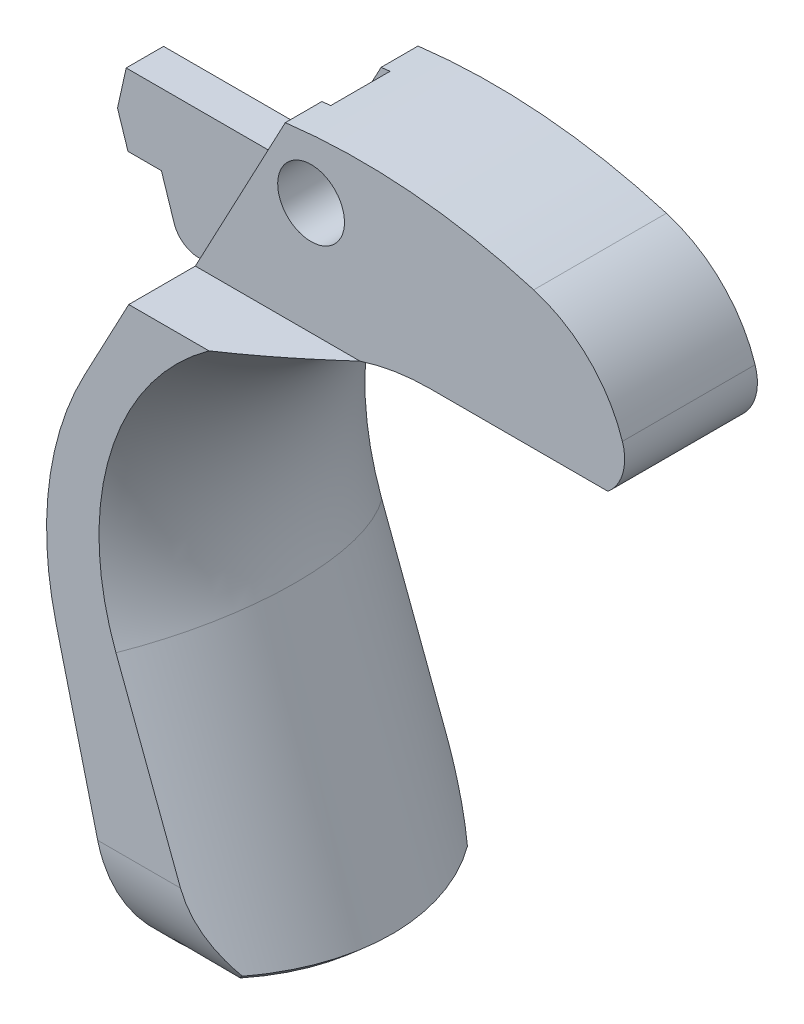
ISO-10303-21;
HEADER;
FILE_DESCRIPTION(('STEP AP214'),'2;1');
FILE_NAME('part.step','',(''),(''),'','','');
FILE_SCHEMA(('AUTOMOTIVE_DESIGN { 1 0 10303 214 1 1 1 1 }'));
ENDSEC;
DATA;
#1=APPLICATION_CONTEXT('core data for automotive mechanical design processes');
#2=APPLICATION_PROTOCOL_DEFINITION('international standard','automotive_design',2000,#1);
#3=PRODUCT_CONTEXT('',#1,'mechanical');
#4=PRODUCT('Part','Part','',(#3));
#5=PRODUCT_RELATED_PRODUCT_CATEGORY('part','',(#4));
#6=PRODUCT_DEFINITION_FORMATION('','',#4);
#7=PRODUCT_DEFINITION_CONTEXT('part definition',#1,'design');
#8=PRODUCT_DEFINITION('design','',#6,#7);
#9=PRODUCT_DEFINITION_SHAPE('','',#8);
#10=(LENGTH_UNIT() NAMED_UNIT(*) SI_UNIT(.MILLI.,.METRE.));
#11=(NAMED_UNIT(*) PLANE_ANGLE_UNIT() SI_UNIT($,.RADIAN.));
#12=(NAMED_UNIT(*) SI_UNIT($,.STERADIAN.) SOLID_ANGLE_UNIT());
#13=UNCERTAINTY_MEASURE_WITH_UNIT(LENGTH_MEASURE(1.E-05),#10,'distance_accuracy_value','');
#14=(GEOMETRIC_REPRESENTATION_CONTEXT(3) GLOBAL_UNCERTAINTY_ASSIGNED_CONTEXT((#13)) GLOBAL_UNIT_ASSIGNED_CONTEXT((#10,
#11,#12)) REPRESENTATION_CONTEXT('',''));
#15=CARTESIAN_POINT('',(0.,0.,0.));
#16=DIRECTION('',(0.,0.,1.));
#17=DIRECTION('',(1.,0.,0.));
#18=AXIS2_PLACEMENT_3D('',#15,#16,#17);
#19=CARTESIAN_POINT('',(13.2346074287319,20.6647976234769,7.8613));
#20=DIRECTION('',(0.,0.,-1.));
#21=DIRECTION('',(-1.,0.,0.));
#22=AXIS2_PLACEMENT_3D('',#19,#20,#21);
#23=PLANE('',#22);
#24=DIRECTION('',(0.352116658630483,-0.935956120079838,0.));
#25=VECTOR('',#24,1.);
#26=CARTESIAN_POINT('',(-1.71331023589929,16.3426131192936,7.8613));
#27=LINE('',#26,#25);
#28=CARTESIAN_POINT('',(-1.71331023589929,16.3426131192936,7.8613));
#29=VERTEX_POINT('',#28);
#30=CARTESIAN_POINT('',(2.10288671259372,6.19883604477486,7.8613));
#31=VERTEX_POINT('',#30);
#32=EDGE_CURVE('E363',#29,#31,#27,.T.);
#33=ORIENTED_EDGE('',*,*,#32,.F.);
#34=CARTESIAN_POINT('',(12.9379619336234,21.8545777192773,7.8613));
#35=DIRECTION('',(0.,0.,1.));
#36=DIRECTION('',(1.,0.,0.));
#37=AXIS2_PLACEMENT_3D('',#34,#35,#36);
#38=CIRCLE('',#37,15.653802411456);
#39=CARTESIAN_POINT('',(3.78637573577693,34.5545777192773,7.86129999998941));
#40=VERTEX_POINT('',#39);
#41=EDGE_CURVE('E360',#40,#29,#38,.T.);
#42=ORIENTED_EDGE('',*,*,#41,.F.);
#43=DIRECTION('',(-1.,0.,0.));
#44=VECTOR('',#43,1.);
#45=CARTESIAN_POINT('',(13.2346074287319,34.5545777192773,7.8613));
#46=LINE('',#45,#44);
#47=CARTESIAN_POINT('',(-0.95552495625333,34.5545777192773,7.8613));
#48=VERTEX_POINT('',#47);
#49=EDGE_CURVE('E618',#40,#48,#46,.T.);
#50=ORIENTED_EDGE('',*,*,#49,.T.);
#51=DIRECTION('',(0.469471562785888,0.882947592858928,0.));
#52=VECTOR('',#51,1.);
#53=CARTESIAN_POINT('',(-3.58554421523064,29.6082308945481,7.8613));
#54=LINE('',#53,#52);
#55=CARTESIAN_POINT('',(-3.58554421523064,29.6082308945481,7.8613));
#56=VERTEX_POINT('',#55);
#57=EDGE_CURVE('E621',#56,#48,#54,.T.);
#58=ORIENTED_EDGE('',*,*,#57,.F.);
#59=CARTESIAN_POINT('',(13.2346074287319,20.6647976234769,7.8613));
#60=DIRECTION('',(0.,0.,-1.));
#61=DIRECTION('',(-1.,0.,0.));
#62=AXIS2_PLACEMENT_3D('',#59,#60,#61);
#63=CIRCLE('',#62,19.05);
#64=CARTESIAN_POINT('',(-5.2495261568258,16.0561855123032,7.8613));
#65=VERTEX_POINT('',#64);
#66=EDGE_CURVE('E612',#65,#56,#63,.T.);
#67=ORIENTED_EDGE('',*,*,#66,.F.);
#68=DIRECTION('',(-0.241921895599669,0.970295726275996,0.));
#69=VECTOR('',#68,1.);
#70=CARTESIAN_POINT('',(-1.26721775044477,0.0840188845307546,7.8613));
#71=LINE('',#70,#69);
#72=CARTESIAN_POINT('',(-2.79181290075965,6.19883604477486,7.8613));
#73=VERTEX_POINT('',#72);
#74=EDGE_CURVE('E619',#73,#65,#71,.T.);
#75=ORIENTED_EDGE('',*,*,#74,.F.);
#76=DIRECTION('',(1.,0.,0.));
#77=VECTOR('',#76,1.);
#78=CARTESIAN_POINT('',(-13.6599364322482,6.19883604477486,7.8613));
#79=LINE('',#78,#77);
#80=EDGE_CURVE('E528',#73,#31,#79,.T.);
#81=ORIENTED_EDGE('',*,*,#80,.T.);
#82=EDGE_LOOP('',(#33,#42,#50,#58,#67,#75,#81));
#83=FACE_BOUND('',#82,.T.);
#84=ADVANCED_FACE('F71',(#83),#23,.F.);
#85=CARTESIAN_POINT('',(13.2346074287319,20.6647976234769,-7.8613));
#86=DIRECTION('',(0.,0.,-1.));
#87=DIRECTION('',(-1.,0.,0.));
#88=AXIS2_PLACEMENT_3D('',#85,#86,#87);
#89=PLANE('',#88);
#90=CARTESIAN_POINT('',(12.9379619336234,21.8545777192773,-7.8613));
#91=DIRECTION('',(0.,0.,1.));
#92=DIRECTION('',(1.,0.,0.));
#93=AXIS2_PLACEMENT_3D('',#90,#91,#92);
#94=CIRCLE('',#93,15.653802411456);
#95=CARTESIAN_POINT('',(3.78637573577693,34.5545777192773,-7.86129999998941));
#96=VERTEX_POINT('',#95);
#97=CARTESIAN_POINT('',(-1.71331023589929,16.3426131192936,-7.8613));
#98=VERTEX_POINT('',#97);
#99=EDGE_CURVE('E357',#96,#98,#94,.T.);
#100=ORIENTED_EDGE('',*,*,#99,.T.);
#101=DIRECTION('',(0.352116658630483,-0.935956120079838,0.));
#102=VECTOR('',#101,1.);
#103=CARTESIAN_POINT('',(-1.71331023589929,16.3426131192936,-7.8613));
#104=LINE('',#103,#102);
#105=CARTESIAN_POINT('',(2.10288671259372,6.19883604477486,-7.8613));
#106=VERTEX_POINT('',#105);
#107=EDGE_CURVE('E367',#98,#106,#104,.T.);
#108=ORIENTED_EDGE('',*,*,#107,.T.);
#109=DIRECTION('',(1.,0.,0.));
#110=VECTOR('',#109,1.);
#111=CARTESIAN_POINT('',(-13.6599364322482,6.19883604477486,-7.8613));
#112=LINE('',#111,#110);
#113=CARTESIAN_POINT('',(-2.79181290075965,6.19883604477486,-7.8613));
#114=VERTEX_POINT('',#113);
#115=EDGE_CURVE('E539',#114,#106,#112,.T.);
#116=ORIENTED_EDGE('',*,*,#115,.F.);
#117=DIRECTION('',(-0.241921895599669,0.970295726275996,0.));
#118=VECTOR('',#117,1.);
#119=CARTESIAN_POINT('',(-1.26721775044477,0.0840188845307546,-7.8613));
#120=LINE('',#119,#118);
#121=CARTESIAN_POINT('',(-5.2495261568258,16.0561855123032,-7.8613));
#122=VERTEX_POINT('',#121);
#123=EDGE_CURVE('E610',#114,#122,#120,.T.);
#124=ORIENTED_EDGE('',*,*,#123,.T.);
#125=CARTESIAN_POINT('',(13.2346074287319,20.6647976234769,-7.8613));
#126=DIRECTION('',(0.,0.,-1.));
#127=DIRECTION('',(-1.,0.,0.));
#128=AXIS2_PLACEMENT_3D('',#125,#126,#127);
#129=CIRCLE('',#128,19.05);
#130=CARTESIAN_POINT('',(-3.58554421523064,29.6082308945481,-7.8613));
#131=VERTEX_POINT('',#130);
#132=EDGE_CURVE('E615',#122,#131,#129,.T.);
#133=ORIENTED_EDGE('',*,*,#132,.T.);
#134=DIRECTION('',(0.469471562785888,0.882947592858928,0.));
#135=VECTOR('',#134,1.);
#136=CARTESIAN_POINT('',(-3.58554421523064,29.6082308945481,-7.8613));
#137=LINE('',#136,#135);
#138=CARTESIAN_POINT('',(-0.955524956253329,34.5545777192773,-7.8613));
#139=VERTEX_POINT('',#138);
#140=EDGE_CURVE('E613',#131,#139,#137,.T.);
#141=ORIENTED_EDGE('',*,*,#140,.T.);
#142=DIRECTION('',(-1.,0.,0.));
#143=VECTOR('',#142,1.);
#144=CARTESIAN_POINT('',(13.2346074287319,34.5545777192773,-7.8613));
#145=LINE('',#144,#143);
#146=EDGE_CURVE('E380',#96,#139,#145,.T.);
#147=ORIENTED_EDGE('',*,*,#146,.F.);
#148=EDGE_LOOP('',(#100,#108,#116,#124,#133,#141,#147));
#149=FACE_BOUND('',#148,.T.);
#150=ADVANCED_FACE('F378',(#149),#89,.T.);
#151=CARTESIAN_POINT('',(0.119306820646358,1.79944927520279,7.8613));
#152=DIRECTION('',(0.0661566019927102,0.997809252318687,0.));
#153=DIRECTION('',(-0.997809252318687,0.0661566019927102,0.));
#154=AXIS2_PLACEMENT_3D('',#151,#152,#153);
#155=PLANE('',#154);
#156=CARTESIAN_POINT('',(-66.2345972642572,6.19883604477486,-1.0033));
#157=DIRECTION('',(0.0661566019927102,0.997809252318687,0.));
#158=DIRECTION('',(0.997809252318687,-0.0661566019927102,0.));
#159=AXIS2_PLACEMENT_3D('',#156,#157,#158);
#160=ELLIPSE('',#159,103.663123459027,6.858);
#161=CARTESIAN_POINT('',(0.119306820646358,1.79944927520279,-6.26424668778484));
#162=VERTEX_POINT('',#161);
#163=CARTESIAN_POINT('',(3.83091218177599,1.55336296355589,-6.04827213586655));
#164=VERTEX_POINT('',#163);
#165=EDGE_CURVE('E541',#162,#164,#160,.F.);
#166=ORIENTED_EDGE('',*,*,#165,.T.);
#167=CARTESIAN_POINT('',(3.36450178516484,1.58428683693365,6.64762341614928));
#168=CARTESIAN_POINT('',(4.9496323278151,1.47918974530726,4.75551800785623));
#169=CARTESIAN_POINT('',(5.82050119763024,1.42144952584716,2.38175120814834));
#170=CARTESIAN_POINT('',(5.82050119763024,1.42144952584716,-2.38175120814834));
#171=CARTESIAN_POINT('',(4.94963232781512,1.47918974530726,-4.75551800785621));
#172=CARTESIAN_POINT('',(3.36450178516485,1.58428683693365,-6.64762341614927));
#173=B_SPLINE_CURVE_WITH_KNOTS('',3,(#167,#168,#169,#170,#171,#172),.UNSPECIFIED.,.F.,.F.,(4,2,
4),(5.63278866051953,6.28318530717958,6.93358195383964),.UNSPECIFIED.);
#174=CARTESIAN_POINT('',(3.83091218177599,1.55336296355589,6.04827213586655));
#175=VERTEX_POINT('',#174);
#176=EDGE_CURVE('E84',#164,#175,#173,.F.);
#177=ORIENTED_EDGE('',*,*,#176,.T.);
#178=CARTESIAN_POINT('',(-66.2345972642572,6.19883604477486,1.0033));
#179=DIRECTION('',(0.0661566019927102,0.997809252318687,0.));
#180=DIRECTION('',(0.997809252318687,-0.0661566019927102,0.));
#181=AXIS2_PLACEMENT_3D('',#178,#179,#180);
#182=ELLIPSE('',#181,103.663123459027,6.858);
#183=CARTESIAN_POINT('',(0.119306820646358,1.79944927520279,6.26424668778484));
#184=VERTEX_POINT('',#183);
#185=EDGE_CURVE('E520',#175,#184,#182,.F.);
#186=ORIENTED_EDGE('',*,*,#185,.T.);
#187=DIRECTION('',(0.,0.,-1.));
#188=VECTOR('',#187,1.);
#189=CARTESIAN_POINT('',(0.119306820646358,1.79944927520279,7.8613));
#190=LINE('',#189,#188);
#191=CARTESIAN_POINT('',(0.119306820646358,1.79944927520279,1.7653));
#192=VERTEX_POINT('',#191);
#193=EDGE_CURVE('E599',#184,#192,#190,.T.);
#194=ORIENTED_EDGE('',*,*,#193,.T.);
#195=DIRECTION('',(0.997809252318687,-0.0661566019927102,0.));
#196=VECTOR('',#195,1.);
#197=CARTESIAN_POINT('',(0.119306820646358,1.79944927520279,1.7653));
#198=LINE('',#197,#196);
#199=CARTESIAN_POINT('',(3.22793719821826,1.59334132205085,1.7653));
#200=VERTEX_POINT('',#199);
#201=EDGE_CURVE('E784',#192,#200,#198,.T.);
#202=ORIENTED_EDGE('',*,*,#201,.T.);
#203=DIRECTION('',(0.,0.,1.));
#204=VECTOR('',#203,1.);
#205=CARTESIAN_POINT('',(3.22793719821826,1.59334132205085,7.8613));
#206=LINE('',#205,#204);
#207=CARTESIAN_POINT('',(3.22793719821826,1.59334132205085,-1.7399));
#208=VERTEX_POINT('',#207);
#209=EDGE_CURVE('E558',#208,#200,#206,.T.);
#210=ORIENTED_EDGE('',*,*,#209,.F.);
#211=DIRECTION('',(0.997809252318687,-0.0661566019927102,0.));
#212=VECTOR('',#211,1.);
#213=CARTESIAN_POINT('',(0.119306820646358,1.79944927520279,-1.7399));
#214=LINE('',#213,#212);
#215=CARTESIAN_POINT('',(0.119306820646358,1.79944927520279,-1.7399));
#216=VERTEX_POINT('',#215);
#217=EDGE_CURVE('E768',#216,#208,#214,.T.);
#218=ORIENTED_EDGE('',*,*,#217,.F.);
#219=EDGE_CURVE('E598',#216,#162,#190,.T.);
#220=ORIENTED_EDGE('',*,*,#219,.T.);
#221=EDGE_LOOP('',(#166,#177,#186,#194,#202,#210,#218,#220));
#222=FACE_BOUND('',#221,.T.);
#223=ADVANCED_FACE('F449',(#222),#155,.F.);
#224=CARTESIAN_POINT('',(-27.94,34.5545777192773,-35.6656646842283));
#225=DIRECTION('',(0.,-1.,0.));
#226=DIRECTION('',(0.,0.,-1.));
#227=AXIS2_PLACEMENT_3D('',#224,#225,#226);
#228=PLANE('',#227);
#229=CARTESIAN_POINT('',(12.9379619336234,34.5545777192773,0.));
#230=CARTESIAN_POINT('',(12.9325679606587,34.5545777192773,0.00522965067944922));
#231=CARTESIAN_POINT('',(12.9271739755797,34.5545777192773,0.0104593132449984));
#232=CARTESIAN_POINT('',(11.5081975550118,34.5545777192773,1.38620630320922));
#233=CARTESIAN_POINT('',(10.0935686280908,34.5545777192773,2.75729627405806));
#234=CARTESIAN_POINT('',(7.88561951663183,34.5545777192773,4.71910313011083));
#235=CARTESIAN_POINT('',(7.13524274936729,34.5545777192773,5.35727832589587));
#236=CARTESIAN_POINT('',(5.594534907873,34.5545777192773,6.58347949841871));
#237=CARTESIAN_POINT('',(4.80422614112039,34.5545777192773,7.17153299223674));
#238=CARTESIAN_POINT('',(3.46724592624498,34.5545777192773,8.07898064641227));
#239=CARTESIAN_POINT('',(2.93471095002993,34.5545777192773,8.41915468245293));
#240=CARTESIAN_POINT('',(1.84882169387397,34.5545777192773,9.06432856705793));
#241=CARTESIAN_POINT('',(1.29547447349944,34.5545777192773,9.36934020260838));
#242=CARTESIAN_POINT('',(0.169739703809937,34.5545777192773,9.93685935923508));
#243=CARTESIAN_POINT('',(-0.402572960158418,34.5545777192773,10.1995144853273));
#244=CARTESIAN_POINT('',(-1.56693324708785,34.5545777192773,10.6769191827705));
#245=CARTESIAN_POINT('',(-2.15897707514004,34.5545777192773,10.8916779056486));
#246=CARTESIAN_POINT('',(-3.22368971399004,34.5545777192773,11.223878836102));
#247=CARTESIAN_POINT('',(-3.6929242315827,34.5545777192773,11.3523455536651));
#248=CARTESIAN_POINT('',(-4.63962460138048,34.5545777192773,11.5734355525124));
#249=CARTESIAN_POINT('',(-5.11708697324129,34.5545777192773,11.6660736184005));
#250=CARTESIAN_POINT('',(-6.08285036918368,34.5545777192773,11.8132675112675));
#251=CARTESIAN_POINT('',(-6.57121197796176,34.5545777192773,11.8674349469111));
#252=CARTESIAN_POINT('',(-7.30611763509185,34.5545777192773,11.9168291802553));
#253=CARTESIAN_POINT('',(-7.55166454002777,34.5545777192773,11.927980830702));
#254=CARTESIAN_POINT('',(-8.04304779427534,34.5545777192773,11.9393052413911));
#255=CARTESIAN_POINT('',(-8.28888418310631,34.5545777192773,11.9394762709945));
#256=CARTESIAN_POINT('',(-8.53463752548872,34.5545777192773,11.9339952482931));
#257=B_SPLINE_CURVE_WITH_KNOTS('',3,(#229,#230,#231,#232,#233,#234,#235,#236,#237,#238,#239,
#240,#241,#242,#243,#244,#245,#246,#247,#248,#249,#250,#251,#252,#253,#254,#255,#256),
.UNSPECIFIED.,.F.,.F.,(4,2,2,2,2,2,2,2,2,2,2,2,2,4),(0.,0.0225388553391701,5.92919955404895,
8.8829725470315,11.8351133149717,13.7297512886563,15.6237522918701,17.5110033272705,
19.3978934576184,20.8561440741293,22.3137923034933,23.7859551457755,24.5231397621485,
25.2604405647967),.UNSPECIFIED.);
#258=CARTESIAN_POINT('',(8.77965501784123,34.5545777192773,3.9243));
#259=VERTEX_POINT('',#258);
#260=EDGE_CURVE('E384',#259,#40,#257,.T.);
#261=ORIENTED_EDGE('',*,*,#260,.F.);
#262=DIRECTION('',(1.,0.,0.));
#263=VECTOR('',#262,1.);
#264=CARTESIAN_POINT('',(-27.94,34.5545777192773,3.92430000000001));
#265=LINE('',#264,#263);
#266=CARTESIAN_POINT('',(-0.95552495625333,34.5545777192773,3.92430000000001));
#267=VERTEX_POINT('',#266);
#268=EDGE_CURVE('E582',#267,#259,#265,.T.);
#269=ORIENTED_EDGE('',*,*,#268,.F.);
#270=DIRECTION('',(0.,0.,1.));
#271=VECTOR('',#270,1.);
#272=CARTESIAN_POINT('',(-0.95552495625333,34.5545777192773,7.8613));
#273=LINE('',#272,#271);
#274=EDGE_CURVE('E574',#267,#48,#273,.T.);
#275=ORIENTED_EDGE('',*,*,#274,.T.);
#276=ORIENTED_EDGE('',*,*,#49,.F.);
#277=EDGE_LOOP('',(#261,#269,#275,#276));
#278=FACE_BOUND('',#277,.T.);
#279=ADVANCED_FACE('F396',(#278),#228,.F.);
#280=CARTESIAN_POINT('',(-27.94,41.1770771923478,3.9243));
#281=DIRECTION('',(0.,0.,1.));
#282=DIRECTION('',(0.,-1.,0.));
#283=AXIS2_PLACEMENT_3D('',#280,#281,#282);
#284=PLANE('',#283);
#285=CARTESIAN_POINT('',(5.88843717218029,41.2043093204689,3.9243));
#286=DIRECTION('',(0.,0.,1.));
#287=DIRECTION('',(0.,-1.,0.));
#288=AXIS2_PLACEMENT_3D('',#285,#286,#287);
#289=CIRCLE('',#288,1.97485);
#290=CARTESIAN_POINT('',(5.88843717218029,39.2294593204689,3.9243));
#291=VERTEX_POINT('',#290);
#292=EDGE_CURVE('E578',#291,#291,#289,.T.);
#293=ORIENTED_EDGE('',*,*,#292,.F.);
#294=EDGE_LOOP('',(#293));
#295=FACE_BOUND('',#294,.T.);
#296=ORIENTED_EDGE('',*,*,#268,.T.);
#297=CARTESIAN_POINT('',(12.9379619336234,21.8545777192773,3.9243));
#298=DIRECTION('',(0.,0.,-1.));
#299=DIRECTION('',(0.,1.,0.));
#300=AXIS2_PLACEMENT_3D('',#297,#298,#299);
#301=CIRCLE('',#300,13.3634395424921);
#302=CARTESIAN_POINT('',(12.9379619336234,35.2180172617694,3.9243));
#303=VERTEX_POINT('',#302);
#304=EDGE_CURVE('E381',#259,#303,#301,.T.);
#305=ORIENTED_EDGE('',*,*,#304,.T.);
#306=DIRECTION('',(1.,0.,0.));
#307=VECTOR('',#306,1.);
#308=CARTESIAN_POINT('',(21.6364371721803,35.2180172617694,3.9243));
#309=LINE('',#308,#307);
#310=CARTESIAN_POINT('',(23.4439625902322,35.2180172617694,3.9243));
#311=VERTEX_POINT('',#310);
#312=EDGE_CURVE('E925',#311,#303,#309,.F.);
#313=ORIENTED_EDGE('',*,*,#312,.F.);
#314=CARTESIAN_POINT('',(21.6364371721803,37.3485777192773,3.9243));
#315=DIRECTION('',(0.,0.,1.));
#316=DIRECTION('',(0.,-1.,0.));
#317=AXIS2_PLACEMENT_3D('',#314,#315,#316);
#318=CIRCLE('',#317,2.794);
#319=CARTESIAN_POINT('',(24.2965805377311,38.203020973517,3.9243));
#320=VERTEX_POINT('',#319);
#321=EDGE_CURVE('E627',#311,#320,#318,.T.);
#322=ORIENTED_EDGE('',*,*,#321,.T.);
#323=CARTESIAN_POINT('',(16.7998128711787,35.7950445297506,3.9243));
#324=DIRECTION('',(0.,0.,1.));
#325=DIRECTION('',(0.,-1.,0.));
#326=AXIS2_PLACEMENT_3D('',#323,#324,#325);
#327=CIRCLE('',#326,7.874);
#328=CARTESIAN_POINT('',(19.0521548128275,43.3400317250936,3.9243));
#329=VERTEX_POINT('',#328);
#330=EDGE_CURVE('E629',#320,#329,#327,.T.);
#331=ORIENTED_EDGE('',*,*,#330,.T.);
#332=CARTESIAN_POINT('',(8.80763178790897,9.02250932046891,3.9243));
#333=DIRECTION('',(0.,0.,1.));
#334=DIRECTION('',(0.,-1.,0.));
#335=AXIS2_PLACEMENT_3D('',#332,#333,#334);
#336=CIRCLE('',#335,35.814);
#337=CARTESIAN_POINT('',(4.36435234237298,44.559811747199,3.9243));
#338=VERTEX_POINT('',#337);
#339=EDGE_CURVE('E631',#338,#329,#336,.F.);
#340=ORIENTED_EDGE('',*,*,#339,.F.);
#341=DIRECTION('',(0.469471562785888,0.882947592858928,0.));
#342=VECTOR('',#341,1.);
#343=CARTESIAN_POINT('',(-3.58554421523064,29.6082308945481,3.9243));
#344=LINE('',#343,#342);
#345=EDGE_CURVE('E581',#267,#338,#344,.T.);
#346=ORIENTED_EDGE('',*,*,#345,.F.);
#347=EDGE_LOOP('',(#296,#305,#313,#322,#331,#340,#346));
#348=FACE_BOUND('',#347,.T.);
#349=ADVANCED_FACE('F435',(#295,#348),#284,.T.);
#350=CARTESIAN_POINT('',(-27.94,41.1770771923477,-3.9243));
#351=DIRECTION('',(0.,0.,1.));
#352=DIRECTION('',(0.,-1.,0.));
#353=AXIS2_PLACEMENT_3D('',#350,#351,#352);
#354=PLANE('',#353);
#355=CARTESIAN_POINT('',(5.88843717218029,41.2043093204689,-3.9243));
#356=DIRECTION('',(0.,0.,1.));
#357=DIRECTION('',(0.,-1.,0.));
#358=AXIS2_PLACEMENT_3D('',#355,#356,#357);
#359=CIRCLE('',#358,1.97485);
#360=CARTESIAN_POINT('',(5.88843717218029,39.2294593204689,-3.9243));
#361=VERTEX_POINT('',#360);
#362=EDGE_CURVE('E653',#361,#361,#359,.T.);
#363=ORIENTED_EDGE('',*,*,#362,.T.);
#364=EDGE_LOOP('',(#363));
#365=FACE_BOUND('',#364,.T.);
#366=CARTESIAN_POINT('',(12.9379619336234,21.8545777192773,-3.9243));
#367=DIRECTION('',(0.,0.,-1.));
#368=DIRECTION('',(0.,1.,0.));
#369=AXIS2_PLACEMENT_3D('',#366,#367,#368);
#370=CIRCLE('',#369,13.3634395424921);
#371=CARTESIAN_POINT('',(8.77965501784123,34.5545777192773,-3.9243));
#372=VERTEX_POINT('',#371);
#373=CARTESIAN_POINT('',(12.9379619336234,35.2180172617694,-3.9243));
#374=VERTEX_POINT('',#373);
#375=EDGE_CURVE('E375',#372,#374,#370,.T.);
#376=ORIENTED_EDGE('',*,*,#375,.F.);
#377=DIRECTION('',(1.,0.,0.));
#378=VECTOR('',#377,1.);
#379=CARTESIAN_POINT('',(-27.94,34.5545777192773,-3.9243));
#380=LINE('',#379,#378);
#381=CARTESIAN_POINT('',(-0.955524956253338,34.5545777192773,-3.9243));
#382=VERTEX_POINT('',#381);
#383=EDGE_CURVE('E655',#382,#372,#380,.T.);
#384=ORIENTED_EDGE('',*,*,#383,.F.);
#385=DIRECTION('',(0.469471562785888,0.882947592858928,0.));
#386=VECTOR('',#385,1.);
#387=CARTESIAN_POINT('',(-3.58554421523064,29.6082308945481,-3.9243));
#388=LINE('',#387,#386);
#389=CARTESIAN_POINT('',(4.36435234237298,44.559811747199,-3.9243));
#390=VERTEX_POINT('',#389);
#391=EDGE_CURVE('E650',#382,#390,#388,.T.);
#392=ORIENTED_EDGE('',*,*,#391,.T.);
#393=CARTESIAN_POINT('',(8.80763178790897,9.02250932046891,-3.92430000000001));
#394=DIRECTION('',(0.,0.,1.));
#395=DIRECTION('',(0.,-1.,0.));
#396=AXIS2_PLACEMENT_3D('',#393,#394,#395);
#397=CIRCLE('',#396,35.814);
#398=CARTESIAN_POINT('',(19.0521548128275,43.3400317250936,-3.9243));
#399=VERTEX_POINT('',#398);
#400=EDGE_CURVE('E648',#390,#399,#397,.F.);
#401=ORIENTED_EDGE('',*,*,#400,.T.);
#402=CARTESIAN_POINT('',(16.7998128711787,35.7950445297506,-3.9243));
#403=DIRECTION('',(0.,0.,1.));
#404=DIRECTION('',(0.,-1.,0.));
#405=AXIS2_PLACEMENT_3D('',#402,#403,#404);
#406=CIRCLE('',#405,7.874);
#407=CARTESIAN_POINT('',(24.2965805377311,38.203020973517,-3.9243));
#408=VERTEX_POINT('',#407);
#409=EDGE_CURVE('E645',#408,#399,#406,.T.);
#410=ORIENTED_EDGE('',*,*,#409,.F.);
#411=CARTESIAN_POINT('',(21.6364371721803,37.3485777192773,-3.9243));
#412=DIRECTION('',(0.,0.,1.));
#413=DIRECTION('',(0.,-1.,0.));
#414=AXIS2_PLACEMENT_3D('',#411,#412,#413);
#415=CIRCLE('',#414,2.794);
#416=CARTESIAN_POINT('',(23.4439625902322,35.2180172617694,-3.9243));
#417=VERTEX_POINT('',#416);
#418=EDGE_CURVE('E643',#417,#408,#415,.T.);
#419=ORIENTED_EDGE('',*,*,#418,.F.);
#420=DIRECTION('',(1.,0.,0.));
#421=VECTOR('',#420,1.);
#422=CARTESIAN_POINT('',(21.6364371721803,35.2180172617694,-3.9243));
#423=LINE('',#422,#421);
#424=EDGE_CURVE('E417',#417,#374,#423,.F.);
#425=ORIENTED_EDGE('',*,*,#424,.T.);
#426=EDGE_LOOP('',(#376,#384,#392,#401,#410,#419,#425));
#427=FACE_BOUND('',#426,.T.);
#428=ADVANCED_FACE('F430',(#365,#427),#354,.F.);
#429=CARTESIAN_POINT('',(-27.94,34.5545777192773,-35.6656646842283));
#430=DIRECTION('',(0.,-1.,0.));
#431=DIRECTION('',(0.,0.,-1.));
#432=AXIS2_PLACEMENT_3D('',#429,#430,#431);
#433=PLANE('',#432);
#434=CARTESIAN_POINT('',(12.9379619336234,34.5545777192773,0.));
#435=CARTESIAN_POINT('',(12.9325679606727,34.5545777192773,-0.00522965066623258));
#436=CARTESIAN_POINT('',(12.9271739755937,34.5545777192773,-0.0104593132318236));
#437=CARTESIAN_POINT('',(11.5077614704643,34.5545777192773,-1.38662910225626));
#438=CARTESIAN_POINT('',(10.09269485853,34.5545777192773,-2.75814312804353));
#439=CARTESIAN_POINT('',(7.88446364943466,34.5545777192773,-4.72009486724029));
#440=CARTESIAN_POINT('',(7.13429849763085,34.5545777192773,-5.35805539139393));
#441=CARTESIAN_POINT('',(5.59404113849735,34.5545777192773,-6.58384691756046));
#442=CARTESIAN_POINT('',(4.80397153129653,34.5545777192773,-7.17170579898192));
#443=CARTESIAN_POINT('',(3.46812354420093,34.5545777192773,-8.07838498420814));
#444=CARTESIAN_POINT('',(2.9364995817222,34.5545777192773,-8.41801207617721));
#445=CARTESIAN_POINT('',(1.85248849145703,34.5545777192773,-9.06222941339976));
#446=CARTESIAN_POINT('',(1.30010778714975,34.5545777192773,-9.36683038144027));
#447=CARTESIAN_POINT('',(0.174478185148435,34.5545777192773,-9.9346427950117));
#448=CARTESIAN_POINT('',(-0.398766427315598,34.5545777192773,-10.197862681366));
#449=CARTESIAN_POINT('',(-1.56500977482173,34.5545777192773,-10.6762210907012));
#450=CARTESIAN_POINT('',(-2.15800286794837,34.5545777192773,-10.8913732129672));
#451=CARTESIAN_POINT('',(-3.22665068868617,34.5545777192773,-11.2248032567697));
#452=CARTESIAN_POINT('',(-3.69890971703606,34.5545777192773,-11.3539852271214));
#453=CARTESIAN_POINT('',(-4.65185030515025,34.5545777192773,-11.576044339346));
#454=CARTESIAN_POINT('',(-5.1325296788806,34.5545777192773,-11.6689307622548));
#455=CARTESIAN_POINT('',(-6.09878706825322,34.5545777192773,-11.8151744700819));
#456=CARTESIAN_POINT('',(-6.58435124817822,34.5545777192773,-11.8686223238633));
#457=CARTESIAN_POINT('',(-7.55832681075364,34.5545777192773,-11.9334697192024));
#458=CARTESIAN_POINT('',(-8.04673788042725,34.5545777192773,-11.9448737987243));
#459=CARTESIAN_POINT('',(-8.94143265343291,34.5545777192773,-11.9249250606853));
#460=CARTESIAN_POINT('',(-9.34787225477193,34.5545777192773,-11.9003646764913));
#461=CARTESIAN_POINT('',(-10.1574287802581,34.5545777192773,-11.8190560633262));
#462=CARTESIAN_POINT('',(-10.5605466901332,34.5545777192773,-11.7623177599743));
#463=CARTESIAN_POINT('',(-11.3634938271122,34.5545777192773,-11.6151815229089));
#464=CARTESIAN_POINT('',(-11.7632826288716,34.5545777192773,-11.5245595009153));
#465=CARTESIAN_POINT('',(-12.3560598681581,34.5545777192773,-11.3629408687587));
#466=CARTESIAN_POINT('',(-12.5526090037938,34.5545777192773,-11.304747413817));
#467=CARTESIAN_POINT('',(-12.9429696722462,34.5545777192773,-11.1797480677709));
#468=CARTESIAN_POINT('',(-13.1367809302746,34.5545777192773,-11.1129413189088));
#469=CARTESIAN_POINT('',(-13.329025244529,34.5545777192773,-11.0418079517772));
#470=B_SPLINE_CURVE_WITH_KNOTS('',3,(#434,#435,#436,#437,#438,#439,#440,#441,#442,#443,#444,
#445,#446,#447,#448,#449,#450,#451,#452,#453,#454,#455,#456,#457,#458,#459,#460,#461,#462,#463,
#464,#465,#466,#467,#468,#469),.UNSPECIFIED.,.F.,.F.,(4,2,2,2,2,2,2,2,2,2,2,2,2,2,2,2,2,4),(0.,
0.0225388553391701,5.93102172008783,8.88389454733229,11.8351133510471,13.7265704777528,
15.6174470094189,17.5079373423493,19.3978921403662,20.8654486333,22.3326296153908,
23.7964307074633,25.2600738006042,26.4804126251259,27.7003752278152,28.9285529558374,
29.5433281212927,30.1581645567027),.UNSPECIFIED.);
#471=EDGE_CURVE('E410',#96,#372,#470,.F.);
#472=ORIENTED_EDGE('',*,*,#471,.F.);
#473=ORIENTED_EDGE('',*,*,#146,.T.);
#474=DIRECTION('',(0.,0.,1.));
#475=VECTOR('',#474,1.);
#476=CARTESIAN_POINT('',(-0.95552495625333,34.5545777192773,7.8613));
#477=LINE('',#476,#475);
#478=CARTESIAN_POINT('',(-0.955524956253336,34.5545777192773,-6.3881));
#479=VERTEX_POINT('',#478);
#480=EDGE_CURVE('E638',#139,#479,#477,.T.);
#481=ORIENTED_EDGE('',*,*,#480,.T.);
#482=DIRECTION('',(-1.,0.,0.));
#483=VECTOR('',#482,1.);
#484=CARTESIAN_POINT('',(-13.1470451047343,34.5545777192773,-6.3881));
#485=LINE('',#484,#483);
#486=CARTESIAN_POINT('',(-13.1470451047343,34.5545777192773,-6.3881));
#487=VERTEX_POINT('',#486);
#488=EDGE_CURVE('E687',#479,#487,#485,.T.);
#489=ORIENTED_EDGE('',*,*,#488,.T.);
#490=DIRECTION('',(0.,0.,1.));
#491=VECTOR('',#490,1.);
#492=CARTESIAN_POINT('',(-13.1470451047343,34.5545777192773,-6.3881));
#493=LINE('',#492,#491);
#494=CARTESIAN_POINT('',(-13.1470451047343,34.5545777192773,-4.1783));
#495=VERTEX_POINT('',#494);
#496=EDGE_CURVE('E678',#487,#495,#493,.T.);
#497=ORIENTED_EDGE('',*,*,#496,.T.);
#498=DIRECTION('',(-1.,0.,0.));
#499=VECTOR('',#498,1.);
#500=CARTESIAN_POINT('',(-13.1470451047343,34.5545777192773,-4.1783));
#501=LINE('',#500,#499);
#502=CARTESIAN_POINT('',(-0.95552495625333,34.5545777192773,-4.1783));
#503=VERTEX_POINT('',#502);
#504=EDGE_CURVE('E698',#503,#495,#501,.T.);
#505=ORIENTED_EDGE('',*,*,#504,.F.);
#506=EDGE_CURVE('E641',#503,#382,#477,.T.);
#507=ORIENTED_EDGE('',*,*,#506,.T.);
#508=ORIENTED_EDGE('',*,*,#383,.T.);
#509=EDGE_LOOP('',(#472,#473,#481,#489,#497,#505,#507,#508));
#510=FACE_BOUND('',#509,.T.);
#511=ADVANCED_FACE('F425',(#510),#433,.F.);
#512=CARTESIAN_POINT('',(-13.6599364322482,6.19883604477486,-1.0033));
#513=DIRECTION('',(1.,0.,0.));
#514=DIRECTION('',(0.,0.,-1.));
#515=AXIS2_PLACEMENT_3D('',#512,#513,#514);
#516=CYLINDRICAL_SURFACE('',#515,6.858);
#517=CARTESIAN_POINT('',(2.10288671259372,6.19883604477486,-7.8613));
#518=CARTESIAN_POINT('',(2.04820482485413,6.34418352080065,-7.86130011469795));
#519=CARTESIAN_POINT('',(1.99731694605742,6.49095784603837,-7.8566762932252));
#520=CARTESIAN_POINT('',(1.90381980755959,6.78655098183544,-7.83767528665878));
#521=CARTESIAN_POINT('',(1.86121208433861,6.93537016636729,-7.82329629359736));
#522=CARTESIAN_POINT('',(1.78477463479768,7.23396310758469,-7.78440192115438));
#523=CARTESIAN_POINT('',(1.75094589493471,7.38373696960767,-7.75988540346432));
#524=CARTESIAN_POINT('',(1.69226246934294,7.68298907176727,-7.7005172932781));
#525=CARTESIAN_POINT('',(1.66740728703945,7.83246732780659,-7.66566627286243));
#526=CARTESIAN_POINT('',(1.6265266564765,8.12982658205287,-7.58563558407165));
#527=CARTESIAN_POINT('',(1.61049970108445,8.27770784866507,-7.54045768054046));
#528=CARTESIAN_POINT('',(1.58680475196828,8.57066101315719,-7.43996034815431));
#529=CARTESIAN_POINT('',(1.57913704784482,8.71573281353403,-7.38464056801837));
#530=CARTESIAN_POINT('',(1.57144040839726,9.00200324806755,-7.2641734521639));
#531=CARTESIAN_POINT('',(1.57141435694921,9.14320039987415,-7.19902241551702));
#532=CARTESIAN_POINT('',(1.57811235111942,9.42073714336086,-7.05934588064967));
#533=CARTESIAN_POINT('',(1.58483908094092,9.55707478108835,-6.98481666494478));
#534=CARTESIAN_POINT('',(1.61380824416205,9.95925461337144,-6.74687916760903));
#535=CARTESIAN_POINT('',(1.64486304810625,10.2165554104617,-6.56984149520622));
#536=CARTESIAN_POINT('',(1.72229101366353,10.7032972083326,-6.18390208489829));
#537=CARTESIAN_POINT('',(1.76866910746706,10.9327292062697,-5.97499009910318));
#538=CARTESIAN_POINT('',(1.84854899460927,11.2713115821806,-5.62224486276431));
#539=CARTESIAN_POINT('',(1.87937203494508,11.3907690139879,-5.48753160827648));
#540=CARTESIAN_POINT('',(1.94261092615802,11.6185943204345,-5.20933104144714));
#541=CARTESIAN_POINT('',(1.97502691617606,11.7269612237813,-5.06584296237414));
#542=CARTESIAN_POINT('',(2.04037624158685,11.9320941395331,-4.77082107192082));
#543=CARTESIAN_POINT('',(2.0733098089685,12.0288547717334,-4.61928357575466));
#544=CARTESIAN_POINT('',(2.13873958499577,12.2102201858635,-4.30900943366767));
#545=CARTESIAN_POINT('',(2.1712357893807,12.2948248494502,-4.15027271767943));
#546=CARTESIAN_POINT('',(2.2377331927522,12.4581655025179,-3.81241726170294));
#547=CARTESIAN_POINT('',(2.27162143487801,12.5357608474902,-3.63272317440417));
#548=CARTESIAN_POINT('',(2.33703672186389,12.6754308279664,-3.26697112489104));
#549=CARTESIAN_POINT('',(2.36856361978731,12.7375044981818,-3.08091276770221));
#550=CARTESIAN_POINT('',(2.42854055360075,12.8455810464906,-2.70371952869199));
#551=CARTESIAN_POINT('',(2.45699094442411,12.8915857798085,-2.51258523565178));
#552=CARTESIAN_POINT('',(2.51027983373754,12.9670747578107,-2.12658879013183));
#553=CARTESIAN_POINT('',(2.53511847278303,12.996559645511,-1.93172678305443));
#554=CARTESIAN_POINT('',(2.58035956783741,13.0382353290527,-1.54373387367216));
#555=CARTESIAN_POINT('',(2.60084229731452,13.0507671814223,-1.35064895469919));
#556=CARTESIAN_POINT('',(2.63783631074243,13.0594512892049,-0.963729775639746));
#557=CARTESIAN_POINT('',(2.6543476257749,13.0556036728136,-0.769895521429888));
#558=CARTESIAN_POINT('',(2.68340951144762,13.0314735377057,-0.382981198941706));
#559=CARTESIAN_POINT('',(2.69596062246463,13.0111932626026,-0.189901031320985));
#560=CARTESIAN_POINT('',(2.71729597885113,12.9542924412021,0.194044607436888));
#561=CARTESIAN_POINT('',(2.72608028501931,12.9176721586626,0.384910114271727));
#562=CARTESIAN_POINT('',(2.7400492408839,12.8295987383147,0.757600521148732));
#563=CARTESIAN_POINT('',(2.74532882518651,12.7785952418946,0.939528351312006));
#564=CARTESIAN_POINT('',(2.75317128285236,12.6617339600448,1.29860384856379));
#565=CARTESIAN_POINT('',(2.75573421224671,12.5958764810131,1.47575161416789));
#566=CARTESIAN_POINT('',(2.75877975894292,12.4497657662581,1.8240131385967));
#567=CARTESIAN_POINT('',(2.7592624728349,12.3695131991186,1.99512717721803));
#568=CARTESIAN_POINT('',(2.75891992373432,12.1951337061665,2.33020616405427));
#569=CARTESIAN_POINT('',(2.75809419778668,12.1010018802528,2.49416856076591));
#570=CARTESIAN_POINT('',(2.75601897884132,11.8983150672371,2.81568534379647));
#571=CARTESIAN_POINT('',(2.75476450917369,11.7896002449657,2.973138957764));
#572=CARTESIAN_POINT('',(2.75288093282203,11.5593964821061,3.27841729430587));
#573=CARTESIAN_POINT('',(2.75225182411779,11.4379075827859,3.42624204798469));
#574=CARTESIAN_POINT('',(2.7527647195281,11.1829613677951,3.71127638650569));
#575=CARTESIAN_POINT('',(2.75390732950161,11.0494999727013,3.84848232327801));
#576=CARTESIAN_POINT('',(2.75918356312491,10.7716595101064,4.11118785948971));
#577=CARTESIAN_POINT('',(2.76331602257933,10.6272847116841,4.23669199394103));
#578=CARTESIAN_POINT('',(2.77584790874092,10.3280921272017,4.47558602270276));
#579=CARTESIAN_POINT('',(2.7842636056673,10.1732364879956,4.58892771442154));
#580=CARTESIAN_POINT('',(2.80661838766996,9.85484352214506,4.80208304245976));
#581=CARTESIAN_POINT('',(2.82055747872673,9.69130618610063,4.90189666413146));
#582=CARTESIAN_POINT('',(2.85509939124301,9.35711519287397,5.0871771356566));
#583=CARTESIAN_POINT('',(2.87569738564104,9.18646676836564,5.17265431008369));
#584=CARTESIAN_POINT('',(2.92452762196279,8.83956234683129,5.32875325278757));
#585=CARTESIAN_POINT('',(2.95275932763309,8.66330674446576,5.39937606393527));
#586=CARTESIAN_POINT('',(3.01560271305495,8.31762939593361,5.52160972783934));
#587=CARTESIAN_POINT('',(3.04972982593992,8.14843233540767,5.57410720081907));
#588=CARTESIAN_POINT('',(3.12563833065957,7.80811049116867,5.66554113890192));
#589=CARTESIAN_POINT('',(3.16741937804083,7.636985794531,5.704478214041));
#590=CARTESIAN_POINT('',(3.25864909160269,7.29424249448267,5.76889763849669));
#591=CARTESIAN_POINT('',(3.30809837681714,7.12262385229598,5.79437890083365));
#592=CARTESIAN_POINT('',(3.4143892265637,6.78023867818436,5.83218132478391));
#593=CARTESIAN_POINT('',(3.47123095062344,6.60947216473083,5.84450220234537));
#594=CARTESIAN_POINT('',(3.5909342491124,6.27237512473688,5.85634964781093));
#595=CARTESIAN_POINT('',(3.65369818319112,6.10601607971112,5.85605654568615));
#596=CARTESIAN_POINT('',(3.78525609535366,5.7761199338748,5.84365143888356));
#597=CARTESIAN_POINT('',(3.85405219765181,5.61258385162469,5.83153525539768));
#598=CARTESIAN_POINT('',(4.06831305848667,5.12740783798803,5.77829455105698));
#599=CARTESIAN_POINT('',(4.22171684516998,4.8110157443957,5.72028310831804));
#600=CARTESIAN_POINT('',(4.56714624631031,4.14969664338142,5.55160802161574));
#601=CARTESIAN_POINT('',(4.76150274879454,3.80770299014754,5.43430193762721));
#602=CARTESIAN_POINT('',(5.05949718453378,3.3147134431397,5.22133620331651));
#603=CARTESIAN_POINT('',(5.16002038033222,3.15354945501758,5.14407353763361));
#604=CARTESIAN_POINT('',(5.36197184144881,2.83817613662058,4.97749637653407));
#605=CARTESIAN_POINT('',(5.46339991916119,2.68396540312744,4.88818432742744));
#606=CARTESIAN_POINT('',(5.68629973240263,2.35246460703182,4.67854971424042));
#607=CARTESIAN_POINT('',(5.80769643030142,2.17677715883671,4.55560375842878));
#608=CARTESIAN_POINT('',(6.04777511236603,1.83647883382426,4.29275928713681));
#609=CARTESIAN_POINT('',(6.16645639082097,1.67187081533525,4.15285642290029));
#610=CARTESIAN_POINT('',(6.39852032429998,1.35491602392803,3.85628947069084));
#611=CARTESIAN_POINT('',(6.51191034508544,1.20255197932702,3.69964974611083));
#612=CARTESIAN_POINT('',(6.73089628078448,0.911148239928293,3.36946392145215));
#613=CARTESIAN_POINT('',(6.83649190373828,0.772109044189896,3.19591718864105));
#614=CARTESIAN_POINT('',(7.07400432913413,0.460379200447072,2.76454524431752));
#615=CARTESIAN_POINT('',(7.20127052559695,0.294182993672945,2.49923894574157));
#616=CARTESIAN_POINT('',(7.37027946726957,0.0706097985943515,2.07926237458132));
#617=CARTESIAN_POINT('',(7.42295677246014,0.000386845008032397,1.93563998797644));
#618=CARTESIAN_POINT('',(7.51989950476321,-0.130714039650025,1.64147651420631));
#619=CARTESIAN_POINT('',(7.56416921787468,-0.191596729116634,1.49093900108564));
#620=CARTESIAN_POINT('',(7.63728097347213,-0.29487234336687,1.2065174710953));
#621=CARTESIAN_POINT('',(7.66743765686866,-0.338668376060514,1.07347860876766));
#622=CARTESIAN_POINT('',(7.72014481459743,-0.418334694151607,0.803628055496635));
#623=CARTESIAN_POINT('',(7.74269900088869,-0.454208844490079,0.666818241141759));
#624=CARTESIAN_POINT('',(7.77964040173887,-0.517592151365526,0.390214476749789));
#625=CARTESIAN_POINT('',(7.79402945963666,-0.545103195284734,0.250421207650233));
#626=CARTESIAN_POINT('',(7.81421724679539,-0.591421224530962,-0.0312222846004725));
#627=CARTESIAN_POINT('',(7.82001589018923,-0.610228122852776,-0.173072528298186));
#628=CARTESIAN_POINT('',(7.82277687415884,-0.638961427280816,-0.458091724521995));
#629=CARTESIAN_POINT('',(7.81971863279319,-0.648867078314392,-0.601262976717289));
#630=CARTESIAN_POINT('',(7.80468257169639,-0.659681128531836,-0.887474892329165));
#631=CARTESIAN_POINT('',(7.79270474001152,-0.660589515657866,-1.03051555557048));
#632=CARTESIAN_POINT('',(7.76000476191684,-0.653541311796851,-1.31537309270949));
#633=CARTESIAN_POINT('',(7.73928222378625,-0.645584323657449,-1.4571899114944));
#634=CARTESIAN_POINT('',(7.68945285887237,-0.621090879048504,-1.73864054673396));
#635=CARTESIAN_POINT('',(7.66034263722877,-0.604550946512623,-1.87827345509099));
#636=CARTESIAN_POINT('',(7.59521441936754,-0.563898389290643,-2.15045944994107));
#637=CARTESIAN_POINT('',(7.55941884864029,-0.54001691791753,-2.28310069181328));
#638=CARTESIAN_POINT('',(7.48098742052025,-0.485006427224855,-2.54482936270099));
#639=CARTESIAN_POINT('',(7.43834944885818,-0.453875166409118,-2.67391567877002));
#640=CARTESIAN_POINT('',(7.30113132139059,-0.350361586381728,-3.05498423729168));
#641=CARTESIAN_POINT('',(7.19721475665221,-0.26783917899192,-3.30090679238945));
#642=CARTESIAN_POINT('',(6.91121418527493,-0.0314399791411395,-3.89541770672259));
#643=CARTESIAN_POINT('',(6.71637571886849,0.137325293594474,-4.23196590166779));
#644=CARTESIAN_POINT('',(6.40229324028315,0.421419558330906,-4.70295596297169));
#645=CARTESIAN_POINT('',(6.29375166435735,0.521478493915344,-4.85455029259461));
#646=CARTESIAN_POINT('',(6.07093383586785,0.731030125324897,-5.14667210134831));
#647=CARTESIAN_POINT('',(5.95665767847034,0.840522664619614,-5.28719976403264));
#648=CARTESIAN_POINT('',(5.68483652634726,1.10631227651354,-5.60265396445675));
#649=CARTESIAN_POINT('',(5.52563698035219,1.26598840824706,-5.77330494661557));
#650=CARTESIAN_POINT('',(5.20284557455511,1.59950640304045,-6.09566050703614));
#651=CARTESIAN_POINT('',(5.03925192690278,1.77335409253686,-6.24735722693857));
#652=CARTESIAN_POINT('',(4.710557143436,2.13465867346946,-6.53209479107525));
#653=CARTESIAN_POINT('',(4.54545505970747,2.32212472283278,-6.66512290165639));
#654=CARTESIAN_POINT('',(4.21685819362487,2.71036622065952,-6.91224901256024));
#655=CARTESIAN_POINT('',(4.05336284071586,2.91113673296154,-7.02635397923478));
#656=CARTESIAN_POINT('',(3.76906851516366,3.27739931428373,-7.21046608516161));
#657=CARTESIAN_POINT('',(3.64727036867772,3.44008484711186,-7.28453324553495));
#658=CARTESIAN_POINT('',(3.40808570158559,3.77358482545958,-7.42067986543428));
#659=CARTESIAN_POINT('',(3.29069953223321,3.94439991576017,-7.48275837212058));
#660=CARTESIAN_POINT('',(3.06264683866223,4.29359752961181,-7.59387465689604));
#661=CARTESIAN_POINT('',(2.95195659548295,4.47194901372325,-7.64296083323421));
#662=CARTESIAN_POINT('',(2.7389697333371,4.83668020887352,-7.72726405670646));
#663=CARTESIAN_POINT('',(2.6366678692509,5.02305479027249,-7.76248982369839));
#664=CARTESIAN_POINT('',(2.45852588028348,5.37247170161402,-7.81323141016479));
#665=CARTESIAN_POINT('',(2.3810900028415,5.53436837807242,-7.83102338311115));
#666=CARTESIAN_POINT('',(2.23502064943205,5.86314437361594,-7.85506261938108));
#667=CARTESIAN_POINT('',(2.16639485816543,6.03002788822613,-7.86129986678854));
#668=CARTESIAN_POINT('',(2.10288671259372,6.19883604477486,-7.8613));
#669=B_SPLINE_CURVE_WITH_KNOTS('',3,(#517,#518,#519,#520,#521,#522,#523,#524,#525,#526,#527,
#528,#529,#530,#531,#532,#533,#534,#535,#536,#537,#538,#539,#540,#541,#542,#543,#544,#545,#546,
#547,#548,#549,#550,#551,#552,#553,#554,#555,#556,#557,#558,#559,#560,#561,#562,#563,#564,#565,
#566,#567,#568,#569,#570,#571,#572,#573,#574,#575,#576,#577,#578,#579,#580,#581,#582,#583,#584,
#585,#586,#587,#588,#589,#590,#591,#592,#593,#594,#595,#596,#597,#598,#599,#600,#601,#602,#603,
#604,#605,#606,#607,#608,#609,#610,#611,#612,#613,#614,#615,#616,#617,#618,#619,#620,#621,#622,
#623,#624,#625,#626,#627,#628,#629,#630,#631,#632,#633,#634,#635,#636,#637,#638,#639,#640,#641,
#642,#643,#644,#645,#646,#647,#648,#649,#650,#651,#652,#653,#654,#655,#656,#657,#658,#659,#660,
#661,#662,#663,#664,#665,#666,#667,#668),.UNSPECIFIED.,.T.,.F.,(4,2,2,2,2,2,2,2,2,2,2,2,2,2,2,2,
2,2,2,2,2,2,2,2,2,2,2,2,2,2,2,2,2,2,2,2,2,2,2,2,2,2,2,2,2,2,2,2,2,2,2,2,2,2,2,2,2,2,2,2,2,2,2,2,
2,2,2,2,2,2,2,2,2,2,2,4),(0.,0.465741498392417,0.931569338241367,1.39744949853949,
1.86330387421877,2.32907869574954,2.79486965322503,3.26083639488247,3.72698842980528,
4.66479283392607,5.60289938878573,6.15041499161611,6.69797850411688,7.245794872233,
7.79361657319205,8.38882407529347,8.98406858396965,9.57924434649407,10.1743969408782,
10.7573889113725,11.3403763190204,11.9232841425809,12.5061825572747,13.0725662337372,
13.6389382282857,14.2052839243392,14.7718300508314,15.3451892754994,15.9185466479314,
16.4921001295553,17.065430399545,17.6409549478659,18.2164801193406,18.791589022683,
19.3666575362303,19.9072140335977,20.4477462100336,20.9883220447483,21.5289095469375,
22.0617713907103,22.5948216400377,23.6603398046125,24.887196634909,25.5019904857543,
26.1166597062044,26.8550555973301,27.5936412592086,28.3311660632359,29.0687184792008,
30.0782148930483,30.5827065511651,31.0869403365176,31.516322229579,31.9454941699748,
32.3745691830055,32.8036484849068,33.2337256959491,33.6638034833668,34.0939005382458,
34.5241719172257,34.9420847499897,35.3601269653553,36.1958071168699,37.4601271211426,
38.0945196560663,38.7289016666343,39.5761034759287,40.4236553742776,41.2717825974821,
42.1195968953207,42.7680397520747,43.4165341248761,44.0625776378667,44.7082140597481,
45.248663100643,45.7895803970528),.UNSPECIFIED.);
#670=CARTESIAN_POINT('',(4.55521536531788,2.31336021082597,-6.6544274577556));
#671=VERTEX_POINT('',#670);
#672=EDGE_CURVE('E371',#671,#106,#669,.T.);
#673=ORIENTED_EDGE('',*,*,#672,.F.);
#674=CARTESIAN_POINT('',(3.83139698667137,1.55340904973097,-6.04831457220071));
#675=CARTESIAN_POINT('',(3.85599279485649,1.58228990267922,-6.07490708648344));
#676=CARTESIAN_POINT('',(3.88101156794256,1.61120511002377,-6.10106835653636));
#677=CARTESIAN_POINT('',(3.93247481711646,1.66980919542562,-6.1531962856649));
#678=CARTESIAN_POINT('',(3.95893929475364,1.69949935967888,-6.1791417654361));
#679=CARTESIAN_POINT('',(4.01331257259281,1.75965799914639,-6.23081886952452));
#680=CARTESIAN_POINT('',(4.04124094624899,1.7901273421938,-6.25652885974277));
#681=CARTESIAN_POINT('',(4.09856233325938,1.85185038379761,-6.30771333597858));
#682=CARTESIAN_POINT('',(4.12797451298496,1.88310458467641,-6.33316573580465));
#683=CARTESIAN_POINT('',(4.18828359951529,1.9464035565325,-6.38381145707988));
#684=CARTESIAN_POINT('',(4.21919924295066,1.97844848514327,-6.40898224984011));
#685=CARTESIAN_POINT('',(4.28253570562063,2.04333566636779,-6.45903905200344));
#686=CARTESIAN_POINT('',(4.31497482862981,2.07617776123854,-6.48390208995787));
#687=CARTESIAN_POINT('',(4.38137845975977,2.14266629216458,-6.53331574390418));
#688=CARTESIAN_POINT('',(4.41536082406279,2.17631227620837,-6.55784294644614));
#689=CARTESIAN_POINT('',(4.48487252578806,2.24441653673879,-6.60655460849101));
#690=CARTESIAN_POINT('',(4.5204193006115,2.27887410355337,-6.63071519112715));
#691=CARTESIAN_POINT('',(4.55630083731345,2.3133119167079,-6.65439425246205));
#692=B_SPLINE_CURVE_WITH_KNOTS('',3,(#674,#675,#676,#677,#678,#679,#680,#681,#682,#683,#684,
#685,#686,#687,#688,#689,#690,#691),.UNSPECIFIED.,.F.,.F.,(4,2,2,2,2,2,2,2,4),(0.,
0.13897571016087,0.28142241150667,0.427437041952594,0.577114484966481,0.730547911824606,
0.88782910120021,1.04904873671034,1.2142966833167),.UNSPECIFIED.);
#693=EDGE_CURVE('E99',#671,#164,#692,.F.);
#694=ORIENTED_EDGE('',*,*,#693,.T.);
#695=ORIENTED_EDGE('',*,*,#165,.F.);
#696=CARTESIAN_POINT('',(0.410994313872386,6.19883604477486,-1.0033));
#697=DIRECTION('',(-0.997809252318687,0.0661566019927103,0.));
#698=DIRECTION('',(0.0661566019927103,0.997809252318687,0.));
#699=AXIS2_PLACEMENT_3D('',#696,#697,#698);
#700=ELLIPSE('',#699,6.8730571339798,6.858);
#701=CARTESIAN_POINT('',(0.,0.,-3.937));
#702=VERTEX_POINT('',#701);
#703=EDGE_CURVE('E544',#702,#162,#700,.F.);
#704=ORIENTED_EDGE('',*,*,#703,.F.);
#705=CARTESIAN_POINT('',(-93.4941604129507,6.19883604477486,-1.0033));
#706=DIRECTION('',(-0.0661566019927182,-0.997809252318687,0.));
#707=DIRECTION('',(0.997809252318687,-0.0661566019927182,0.));
#708=AXIS2_PLACEMENT_3D('',#705,#706,#707);
#709=ELLIPSE('',#708,103.663123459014,6.858);
#710=CARTESIAN_POINT('',(-1.26721775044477,0.0840188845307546,-4.10832417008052));
#711=VERTEX_POINT('',#710);
#712=EDGE_CURVE('E812',#702,#711,#709,.F.);
#713=ORIENTED_EDGE('',*,*,#712,.T.);
#714=CARTESIAN_POINT('',(-2.79181290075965,6.19883604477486,-1.0033));
#715=DIRECTION('',(-0.970295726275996,-0.241921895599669,0.));
#716=DIRECTION('',(0.241921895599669,-0.970295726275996,0.));
#717=AXIS2_PLACEMENT_3D('',#714,#715,#716);
#718=ELLIPSE('',#717,7.0679482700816,6.858);
#719=EDGE_CURVE('E803',#711,#114,#718,.F.);
#720=ORIENTED_EDGE('',*,*,#719,.T.);
#721=ORIENTED_EDGE('',*,*,#115,.T.);
#722=EDGE_LOOP('',(#673,#694,#695,#704,#713,#720,#721));
#723=FACE_BOUND('',#722,.T.);
#724=ADVANCED_FACE('F429',(#723),#516,.T.);
#725=CARTESIAN_POINT('',(-13.6599364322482,6.19883604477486,1.0033));
#726=DIRECTION('',(1.,0.,0.));
#727=DIRECTION('',(0.,0.,-1.));
#728=AXIS2_PLACEMENT_3D('',#725,#726,#727);
#729=CYLINDRICAL_SURFACE('',#728,6.858);
#730=ORIENTED_EDGE('',*,*,#185,.F.);
#731=CARTESIAN_POINT('',(4.5563008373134,2.31331191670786,6.65439425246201));
#732=CARTESIAN_POINT('',(4.52041930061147,2.27887410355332,6.6307151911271));
#733=CARTESIAN_POINT('',(4.48487252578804,2.24441653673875,6.60655460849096));
#734=CARTESIAN_POINT('',(4.41536082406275,2.17631227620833,6.5578429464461));
#735=CARTESIAN_POINT('',(4.38137845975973,2.14266629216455,6.53331574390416));
#736=CARTESIAN_POINT('',(4.31497482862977,2.07617776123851,6.48390208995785));
#737=CARTESIAN_POINT('',(4.28253570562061,2.04333566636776,6.45903905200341));
#738=CARTESIAN_POINT('',(4.21919924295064,1.97844848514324,6.40898224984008));
#739=CARTESIAN_POINT('',(4.18828359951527,1.94640355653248,6.38381145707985));
#740=CARTESIAN_POINT('',(4.12797451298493,1.88310458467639,6.33316573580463));
#741=CARTESIAN_POINT('',(4.09856233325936,1.85185038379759,6.30771333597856));
#742=CARTESIAN_POINT('',(4.04124094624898,1.79012734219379,6.25652885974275));
#743=CARTESIAN_POINT('',(4.0133125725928,1.75965799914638,6.2308188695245));
#744=CARTESIAN_POINT('',(3.95893929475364,1.69949935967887,6.17914176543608));
#745=CARTESIAN_POINT('',(3.93247481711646,1.66980919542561,6.15319628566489));
#746=CARTESIAN_POINT('',(3.88101156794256,1.61120511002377,6.10106835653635));
#747=CARTESIAN_POINT('',(3.85599279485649,1.58228990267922,6.07490708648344));
#748=CARTESIAN_POINT('',(3.83139698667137,1.55340904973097,6.04831457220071));
#749=B_SPLINE_CURVE_WITH_KNOTS('',3,(#731,#732,#733,#734,#735,#736,#737,#738,#739,#740,#741,
#742,#743,#744,#745,#746,#747,#748),.UNSPECIFIED.,.F.,.F.,(4,2,2,2,2,2,2,2,4),(0.,
0.165247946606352,0.326467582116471,0.483748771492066,0.637182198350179,0.786859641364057,
0.932874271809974,1.07532097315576,1.21429668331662),.UNSPECIFIED.);
#750=CARTESIAN_POINT('',(4.555215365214,2.31336021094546,6.65442745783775));
#751=VERTEX_POINT('',#750);
#752=EDGE_CURVE('E12',#175,#751,#749,.F.);
#753=ORIENTED_EDGE('',*,*,#752,.T.);
#754=CARTESIAN_POINT('',(2.10288671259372,6.19883604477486,7.8613));
#755=CARTESIAN_POINT('',(2.14081058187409,6.09801848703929,7.86130004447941));
#756=CARTESIAN_POINT('',(2.18055348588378,5.99791690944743,7.85907686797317));
#757=CARTESIAN_POINT('',(2.26338728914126,5.79933499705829,7.85037508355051));
#758=CARTESIAN_POINT('',(2.30647701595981,5.70085410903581,7.84389795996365));
#759=CARTESIAN_POINT('',(2.4401375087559,5.40853717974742,7.81841452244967));
#760=CARTESIAN_POINT('',(2.53530285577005,5.21729276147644,7.79335407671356));
#761=CARTESIAN_POINT('',(2.73485292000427,4.84381523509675,7.72876016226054));
#762=CARTESIAN_POINT('',(2.83917950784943,4.6615353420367,7.68931355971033));
#763=CARTESIAN_POINT('',(3.05543062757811,4.30485599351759,7.5971572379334));
#764=CARTESIAN_POINT('',(3.16736124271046,4.1304630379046,7.54443680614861));
#765=CARTESIAN_POINT('',(3.43018753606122,3.74006249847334,7.40960961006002));
#766=CARTESIAN_POINT('',(3.58294178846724,3.52671708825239,7.32341593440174));
#767=CARTESIAN_POINT('',(3.89405103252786,3.11307879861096,7.13210038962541));
#768=CARTESIAN_POINT('',(4.05240633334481,2.91278664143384,7.02697747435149));
#769=CARTESIAN_POINT('',(4.37221760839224,2.52423378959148,6.79816664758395));
#770=CARTESIAN_POINT('',(4.53368299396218,2.33602110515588,6.67441049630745));
#771=CARTESIAN_POINT('',(4.85631523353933,1.97242718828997,6.40888189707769));
#772=CARTESIAN_POINT('',(5.01748204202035,1.79704777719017,6.26710689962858));
#773=CARTESIAN_POINT('',(5.33486421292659,1.46154776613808,5.96719779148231));
#774=CARTESIAN_POINT('',(5.49111556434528,1.30127150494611,5.80927650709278));
#775=CARTESIAN_POINT('',(5.79774543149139,0.994674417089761,5.47545824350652));
#776=CARTESIAN_POINT('',(5.94812771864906,0.84834453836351,5.29957307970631));
#777=CARTESIAN_POINT('',(6.2395107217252,0.571520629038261,4.9299468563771));
#778=CARTESIAN_POINT('',(6.38054630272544,0.440966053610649,4.73627943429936));
#779=CARTESIAN_POINT('',(6.58296800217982,0.258063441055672,4.43163104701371));
#780=CARTESIAN_POINT('',(6.64899238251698,0.199189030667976,4.32759268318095));
#781=CARTESIAN_POINT('',(6.7774697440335,0.0861256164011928,4.11480199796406));
#782=CARTESIAN_POINT('',(6.83992121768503,0.0319385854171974,4.00604772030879));
#783=CARTESIAN_POINT('',(6.90032844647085,-0.0197264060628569,3.89495092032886));
#784=B_SPLINE_CURVE_WITH_KNOTS('',3,(#754,#755,#756,#757,#758,#759,#760,#761,#762,#763,#764,
#765,#766,#767,#768,#769,#770,#771,#772,#773,#774,#775,#776,#777,#778,#779,#780,#781,#782,#783),
.UNSPECIFIED.,.F.,.F.,(4,2,2,2,2,2,2,2,2,2,2,2,2,2,4),(0.,0.323051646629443,0.645990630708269,
1.29016227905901,1.93050701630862,2.57137020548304,3.39877016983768,4.2262158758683,
5.05676912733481,5.88744002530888,6.70830698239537,7.52863746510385,8.34571219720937,
8.75521620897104,9.1648917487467),.UNSPECIFIED.);
#785=EDGE_CURVE('E418',#31,#751,#784,.T.);
#786=ORIENTED_EDGE('',*,*,#785,.F.);
#787=ORIENTED_EDGE('',*,*,#80,.F.);
#788=CARTESIAN_POINT('',(-2.79181290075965,6.19883604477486,1.0033));
#789=DIRECTION('',(-0.970295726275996,-0.241921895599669,0.));
#790=DIRECTION('',(0.241921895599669,-0.970295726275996,0.));
#791=AXIS2_PLACEMENT_3D('',#788,#789,#790);
#792=ELLIPSE('',#791,7.0679482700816,6.858);
#793=CARTESIAN_POINT('',(-1.26721775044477,0.0840188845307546,4.10832417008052));
#794=VERTEX_POINT('',#793);
#795=EDGE_CURVE('E537',#73,#794,#792,.F.);
#796=ORIENTED_EDGE('',*,*,#795,.T.);
#797=CARTESIAN_POINT('',(-93.4941604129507,6.19883604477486,1.0033));
#798=DIRECTION('',(-0.0661566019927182,-0.997809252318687,0.));
#799=DIRECTION('',(0.997809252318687,-0.0661566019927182,0.));
#800=AXIS2_PLACEMENT_3D('',#797,#798,#799);
#801=ELLIPSE('',#800,103.663123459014,6.858);
#802=CARTESIAN_POINT('',(0.,0.,3.937));
#803=VERTEX_POINT('',#802);
#804=EDGE_CURVE('E535',#794,#803,#801,.F.);
#805=ORIENTED_EDGE('',*,*,#804,.T.);
#806=CARTESIAN_POINT('',(0.410994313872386,6.19883604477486,1.0033));
#807=DIRECTION('',(-0.997809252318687,0.0661566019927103,0.));
#808=DIRECTION('',(0.0661566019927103,0.997809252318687,0.));
#809=AXIS2_PLACEMENT_3D('',#806,#807,#808);
#810=ELLIPSE('',#809,6.8730571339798,6.858);
#811=EDGE_CURVE('E527',#184,#803,#810,.F.);
#812=ORIENTED_EDGE('',*,*,#811,.F.);
#813=EDGE_LOOP('',(#730,#753,#786,#787,#796,#805,#812));
#814=FACE_BOUND('',#813,.T.);
#815=ADVANCED_FACE('F494',(#814),#729,.T.);
#816=CARTESIAN_POINT('',(13.2346074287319,20.6647976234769,7.8613));
#817=DIRECTION('',(0.,0.,-1.));
#818=DIRECTION('',(-1.,0.,0.));
#819=AXIS2_PLACEMENT_3D('',#816,#817,#818);
#820=CYLINDRICAL_SURFACE('',#819,19.05);
#821=DIRECTION('',(0.,0.,-1.));
#822=VECTOR('',#821,1.);
#823=CARTESIAN_POINT('',(-4.5124625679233,27.5889586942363,7.8613));
#824=LINE('',#823,#822);
#825=CARTESIAN_POINT('',(-4.5124625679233,27.5889586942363,-1.7399));
#826=VERTEX_POINT('',#825);
#827=CARTESIAN_POINT('',(-4.5124625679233,27.5889586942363,-4.0767));
#828=VERTEX_POINT('',#827);
#829=EDGE_CURVE('E566',#826,#828,#824,.T.);
#830=ORIENTED_EDGE('',*,*,#829,.F.);
#831=CARTESIAN_POINT('',(13.2346074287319,20.6647976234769,-1.7399));
#832=DIRECTION('',(0.,0.,1.));
#833=DIRECTION('',(1.,0.,0.));
#834=AXIS2_PLACEMENT_3D('',#831,#832,#833);
#835=CIRCLE('',#834,19.05);
#836=CARTESIAN_POINT('',(-3.58554421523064,29.6082308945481,-1.7399));
#837=VERTEX_POINT('',#836);
#838=EDGE_CURVE('E726',#826,#837,#835,.F.);
#839=ORIENTED_EDGE('',*,*,#838,.T.);
#840=DIRECTION('',(0.,0.,-1.));
#841=VECTOR('',#840,1.);
#842=CARTESIAN_POINT('',(-3.58554421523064,29.6082308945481,7.8613));
#843=LINE('',#842,#841);
#844=CARTESIAN_POINT('',(-3.58554421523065,29.6082308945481,-4.1783));
#845=VERTEX_POINT('',#844);
#846=EDGE_CURVE('E587',#837,#845,#843,.T.);
#847=ORIENTED_EDGE('',*,*,#846,.T.);
#848=CARTESIAN_POINT('',(13.2346074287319,20.6647976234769,-4.1783));
#849=DIRECTION('',(0.,0.,-1.));
#850=DIRECTION('',(1.,0.,0.));
#851=AXIS2_PLACEMENT_3D('',#848,#849,#850);
#852=CIRCLE('',#851,19.05);
#853=CARTESIAN_POINT('',(-4.7380610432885,26.9803093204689,-4.1783));
#854=VERTEX_POINT('',#853);
#855=EDGE_CURVE('E705',#854,#845,#852,.T.);
#856=ORIENTED_EDGE('',*,*,#855,.F.);
#857=DIRECTION('',(0.,0.,1.));
#858=VECTOR('',#857,1.);
#859=CARTESIAN_POINT('',(-4.7380610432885,26.9803093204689,-6.3881));
#860=LINE('',#859,#858);
#861=CARTESIAN_POINT('',(-4.7380610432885,26.9803093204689,-6.3881));
#862=VERTEX_POINT('',#861);
#863=EDGE_CURVE('E695',#862,#854,#860,.T.);
#864=ORIENTED_EDGE('',*,*,#863,.F.);
#865=CARTESIAN_POINT('',(13.2346074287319,20.6647976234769,-6.3881));
#866=DIRECTION('',(0.,0.,-1.));
#867=DIRECTION('',(1.,0.,0.));
#868=AXIS2_PLACEMENT_3D('',#865,#866,#867);
#869=CIRCLE('',#868,19.05);
#870=CARTESIAN_POINT('',(-3.58554421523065,29.6082308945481,-6.3881));
#871=VERTEX_POINT('',#870);
#872=EDGE_CURVE('E732',#862,#871,#869,.T.);
#873=ORIENTED_EDGE('',*,*,#872,.T.);
#874=EDGE_CURVE('E588',#871,#131,#843,.T.);
#875=ORIENTED_EDGE('',*,*,#874,.T.);
#876=ORIENTED_EDGE('',*,*,#132,.F.);
#877=DIRECTION('',(0.,0.,-1.));
#878=VECTOR('',#877,1.);
#879=CARTESIAN_POINT('',(-5.2495261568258,16.0561855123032,7.8613));
#880=LINE('',#879,#878);
#881=CARTESIAN_POINT('',(-5.2495261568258,16.0561855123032,-4.0767));
#882=VERTEX_POINT('',#881);
#883=EDGE_CURVE('E607',#882,#122,#880,.T.);
#884=ORIENTED_EDGE('',*,*,#883,.F.);
#885=CARTESIAN_POINT('',(13.2346074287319,20.6647976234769,-4.0767));
#886=DIRECTION('',(0.,0.,1.));
#887=DIRECTION('',(1.,0.,0.));
#888=AXIS2_PLACEMENT_3D('',#885,#886,#887);
#889=CIRCLE('',#888,19.05);
#890=EDGE_CURVE('E658',#882,#828,#889,.F.);
#891=ORIENTED_EDGE('',*,*,#890,.T.);
#892=EDGE_LOOP('',(#830,#839,#847,#856,#864,#873,#875,#876,#884,#891));
#893=FACE_BOUND('',#892,.T.);
#894=ADVANCED_FACE('F503',(#893),#820,.T.);
#895=CARTESIAN_POINT('',(-1.26721775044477,0.0840188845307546,7.8613));
#896=DIRECTION('',(-0.970295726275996,-0.241921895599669,0.));
#897=DIRECTION('',(0.241921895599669,-0.970295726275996,0.));
#898=AXIS2_PLACEMENT_3D('',#895,#896,#897);
#899=PLANE('',#898);
#900=ORIENTED_EDGE('',*,*,#719,.F.);
#901=DIRECTION('',(0.,0.,-1.));
#902=VECTOR('',#901,1.);
#903=CARTESIAN_POINT('',(-1.26721775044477,0.0840188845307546,7.8613));
#904=LINE('',#903,#902);
#905=CARTESIAN_POINT('',(-1.26721775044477,0.0840188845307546,-1.7399));
#906=VERTEX_POINT('',#905);
#907=EDGE_CURVE('E604',#906,#711,#904,.T.);
#908=ORIENTED_EDGE('',*,*,#907,.F.);
#909=DIRECTION('',(-0.241921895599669,0.970295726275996,0.));
#910=VECTOR('',#909,1.);
#911=CARTESIAN_POINT('',(-1.26721775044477,0.0840188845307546,-1.7399));
#912=LINE('',#911,#910);
#913=CARTESIAN_POINT('',(-2.31449216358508,4.28440713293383,-1.7399));
#914=VERTEX_POINT('',#913);
#915=EDGE_CURVE('E760',#906,#914,#912,.T.);
#916=ORIENTED_EDGE('',*,*,#915,.T.);
#917=DIRECTION('',(0.,0.,1.));
#918=VECTOR('',#917,1.);
#919=CARTESIAN_POINT('',(-2.31449216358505,4.28440713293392,-4.0767));
#920=LINE('',#919,#918);
#921=CARTESIAN_POINT('',(-2.31449216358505,4.28440713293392,-4.0767));
#922=VERTEX_POINT('',#921);
#923=EDGE_CURVE('E664',#922,#914,#920,.T.);
#924=ORIENTED_EDGE('',*,*,#923,.F.);
#925=DIRECTION('',(-0.241921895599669,0.970295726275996,0.));
#926=VECTOR('',#925,1.);
#927=CARTESIAN_POINT('',(-1.26721775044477,0.0840188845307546,-4.0767));
#928=LINE('',#927,#926);
#929=EDGE_CURVE('E569',#922,#882,#928,.T.);
#930=ORIENTED_EDGE('',*,*,#929,.T.);
#931=ORIENTED_EDGE('',*,*,#883,.T.);
#932=ORIENTED_EDGE('',*,*,#123,.F.);
#933=EDGE_LOOP('',(#900,#908,#916,#924,#930,#931,#932));
#934=FACE_BOUND('',#933,.T.);
#935=ADVANCED_FACE('F460',(#934),#899,.T.);
#936=CARTESIAN_POINT('',(8.80763178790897,9.02250932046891,7.8613));
#937=DIRECTION('',(0.,0.,-1.));
#938=DIRECTION('',(-1.,0.,0.));
#939=AXIS2_PLACEMENT_3D('',#936,#937,#938);
#940=CYLINDRICAL_SURFACE('',#939,35.814);
#941=DIRECTION('',(0.,0.,-1.));
#942=VECTOR('',#941,1.);
#943=CARTESIAN_POINT('',(4.36435234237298,44.559811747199,7.8613));
#944=LINE('',#943,#942);
#945=CARTESIAN_POINT('',(4.36435234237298,44.559811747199,-1.7399));
#946=VERTEX_POINT('',#945);
#947=EDGE_CURVE('E586',#946,#390,#944,.T.);
#948=ORIENTED_EDGE('',*,*,#947,.F.);
#949=CARTESIAN_POINT('',(8.80763178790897,9.02250932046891,-1.7399));
#950=DIRECTION('',(0.,0.,1.));
#951=DIRECTION('',(1.,0.,0.));
#952=AXIS2_PLACEMENT_3D('',#949,#950,#951);
#953=CIRCLE('',#952,35.814);
#954=CARTESIAN_POINT('',(4.89535548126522,44.6221819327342,-1.7399));
#955=VERTEX_POINT('',#954);
#956=EDGE_CURVE('E754',#946,#955,#953,.F.);
#957=ORIENTED_EDGE('',*,*,#956,.T.);
#958=DIRECTION('',(0.,0.,1.));
#959=VECTOR('',#958,1.);
#960=CARTESIAN_POINT('',(4.89535548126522,44.6221819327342,-1.7399));
#961=LINE('',#960,#959);
#962=CARTESIAN_POINT('',(4.89535548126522,44.6221819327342,1.7653));
#963=VERTEX_POINT('',#962);
#964=EDGE_CURVE('E787',#955,#963,#961,.T.);
#965=ORIENTED_EDGE('',*,*,#964,.T.);
#966=CARTESIAN_POINT('',(8.80763178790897,9.02250932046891,1.7653));
#967=DIRECTION('',(0.,0.,1.));
#968=DIRECTION('',(1.,0.,0.));
#969=AXIS2_PLACEMENT_3D('',#966,#967,#968);
#970=CIRCLE('',#969,35.814);
#971=CARTESIAN_POINT('',(4.36435234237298,44.559811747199,1.7653));
#972=VERTEX_POINT('',#971);
#973=EDGE_CURVE('E772',#972,#963,#970,.F.);
#974=ORIENTED_EDGE('',*,*,#973,.F.);
#975=EDGE_CURVE('E589',#338,#972,#944,.T.);
#976=ORIENTED_EDGE('',*,*,#975,.F.);
#977=ORIENTED_EDGE('',*,*,#339,.T.);
#978=DIRECTION('',(0.,0.,-1.));
#979=VECTOR('',#978,1.);
#980=CARTESIAN_POINT('',(19.0521548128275,43.3400317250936,7.8613));
#981=LINE('',#980,#979);
#982=EDGE_CURVE('E592',#329,#399,#981,.T.);
#983=ORIENTED_EDGE('',*,*,#982,.T.);
#984=ORIENTED_EDGE('',*,*,#400,.F.);
#985=EDGE_LOOP('',(#948,#957,#965,#974,#976,#977,#983,#984));
#986=FACE_BOUND('',#985,.T.);
#987=ADVANCED_FACE('F833',(#986),#940,.T.);
#988=CARTESIAN_POINT('',(-3.58554421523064,29.6082308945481,7.8613));
#989=DIRECTION('',(-0.882947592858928,0.469471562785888,0.));
#990=DIRECTION('',(-0.469471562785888,-0.882947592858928,0.));
#991=AXIS2_PLACEMENT_3D('',#988,#989,#990);
#992=PLANE('',#991);
#993=ORIENTED_EDGE('',*,*,#846,.F.);
#994=DIRECTION('',(0.469471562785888,0.882947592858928,0.));
#995=VECTOR('',#994,1.);
#996=CARTESIAN_POINT('',(-3.58554421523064,29.6082308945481,-1.7399));
#997=LINE('',#996,#995);
#998=EDGE_CURVE('E757',#837,#946,#997,.T.);
#999=ORIENTED_EDGE('',*,*,#998,.T.);
#1000=ORIENTED_EDGE('',*,*,#947,.T.);
#1001=ORIENTED_EDGE('',*,*,#391,.F.);
#1002=ORIENTED_EDGE('',*,*,#506,.F.);
#1003=DIRECTION('',(0.469471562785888,0.882947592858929,0.));
#1004=VECTOR('',#1003,1.);
#1005=CARTESIAN_POINT('',(-0.955524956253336,34.5545777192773,-4.1783));
#1006=LINE('',#1005,#1004);
#1007=EDGE_CURVE('E702',#845,#503,#1006,.T.);
#1008=ORIENTED_EDGE('',*,*,#1007,.F.);
#1009=EDGE_LOOP('',(#993,#999,#1000,#1001,#1002,#1008));
#1010=FACE_BOUND('',#1009,.T.);
#1011=ADVANCED_FACE('F839',(#1010),#992,.T.);
#1012=CARTESIAN_POINT('',(0.,0.,7.8613));
#1013=DIRECTION('',(-0.0661566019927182,-0.997809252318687,0.));
#1014=DIRECTION('',(0.997809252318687,-0.0661566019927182,0.));
#1015=AXIS2_PLACEMENT_3D('',#1012,#1013,#1014);
#1016=PLANE('',#1015);
#1017=ORIENTED_EDGE('',*,*,#712,.F.);
#1018=DIRECTION('',(0.,0.,-1.));
#1019=VECTOR('',#1018,1.);
#1020=CARTESIAN_POINT('',(0.,0.,7.8613));
#1021=LINE('',#1020,#1019);
#1022=CARTESIAN_POINT('',(0.,0.,-1.7399));
#1023=VERTEX_POINT('',#1022);
#1024=EDGE_CURVE('E601',#1023,#702,#1021,.T.);
#1025=ORIENTED_EDGE('',*,*,#1024,.F.);
#1026=DIRECTION('',(-0.997809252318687,0.0661566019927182,0.));
#1027=VECTOR('',#1026,1.);
#1028=CARTESIAN_POINT('',(0.,0.,-1.7399));
#1029=LINE('',#1028,#1027);
#1030=EDGE_CURVE('E763',#1023,#906,#1029,.T.);
#1031=ORIENTED_EDGE('',*,*,#1030,.T.);
#1032=ORIENTED_EDGE('',*,*,#907,.T.);
#1033=EDGE_LOOP('',(#1017,#1025,#1031,#1032));
#1034=FACE_BOUND('',#1033,.T.);
#1035=ADVANCED_FACE('F466',(#1034),#1016,.T.);
#1036=CARTESIAN_POINT('',(0.,0.,7.8613));
#1037=DIRECTION('',(-0.997809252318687,0.0661566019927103,0.));
#1038=DIRECTION('',(-0.0661566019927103,-0.997809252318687,0.));
#1039=AXIS2_PLACEMENT_3D('',#1036,#1037,#1038);
#1040=PLANE('',#1039);
#1041=ORIENTED_EDGE('',*,*,#1024,.T.);
#1042=ORIENTED_EDGE('',*,*,#703,.T.);
#1043=ORIENTED_EDGE('',*,*,#219,.F.);
#1044=DIRECTION('',(0.0661566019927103,0.997809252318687,0.));
#1045=VECTOR('',#1044,1.);
#1046=CARTESIAN_POINT('',(0.,0.,-1.7399));
#1047=LINE('',#1046,#1045);
#1048=EDGE_CURVE('E766',#1023,#216,#1047,.T.);
#1049=ORIENTED_EDGE('',*,*,#1048,.F.);
#1050=EDGE_LOOP('',(#1041,#1042,#1043,#1049));
#1051=FACE_BOUND('',#1050,.T.);
#1052=ADVANCED_FACE('F470',(#1051),#1040,.F.);
#1053=CARTESIAN_POINT('',(-1.69230915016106,16.2779411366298,-4.0767));
#1054=DIRECTION('',(0.970295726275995,0.241921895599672,0.));
#1055=DIRECTION('',(-0.241921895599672,0.970295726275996,0.));
#1056=AXIS2_PLACEMENT_3D('',#1053,#1054,#1055);
#1057=PLANE('',#1056);
#1058=DIRECTION('',(-0.241921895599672,0.970295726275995,0.));
#1059=VECTOR('',#1058,1.);
#1060=CARTESIAN_POINT('',(10.0652708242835,-30.8791364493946,-1.7399));
#1061=LINE('',#1060,#1059);
#1062=CARTESIAN_POINT('',(-1.69230915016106,16.2779411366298,-1.7399));
#1063=VERTEX_POINT('',#1062);
#1064=EDGE_CURVE('E806',#1063,#826,#1061,.T.);
#1065=ORIENTED_EDGE('',*,*,#1064,.T.);
#1066=ORIENTED_EDGE('',*,*,#829,.T.);
#1067=DIRECTION('',(-0.241921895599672,0.970295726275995,0.));
#1068=VECTOR('',#1067,1.);
#1069=CARTESIAN_POINT('',(-1.69230915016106,16.2779411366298,-4.0767));
#1070=LINE('',#1069,#1068);
#1071=CARTESIAN_POINT('',(-1.69230915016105,16.2779411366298,-4.0767));
#1072=VERTEX_POINT('',#1071);
#1073=EDGE_CURVE('E674',#1072,#828,#1070,.T.);
#1074=ORIENTED_EDGE('',*,*,#1073,.F.);
#1075=DIRECTION('',(0.,0.,1.));
#1076=VECTOR('',#1075,1.);
#1077=CARTESIAN_POINT('',(-1.69230915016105,16.2779411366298,-4.0767));
#1078=LINE('',#1077,#1076);
#1079=EDGE_CURVE('E663',#1072,#1063,#1078,.T.);
#1080=ORIENTED_EDGE('',*,*,#1079,.T.);
#1081=EDGE_LOOP('',(#1065,#1066,#1074,#1080));
#1082=FACE_BOUND('',#1081,.T.);
#1083=ADVANCED_FACE('F868',(#1082),#1057,.F.);
#1084=CARTESIAN_POINT('',(-21.6551734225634,11.3006400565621,-4.0767));
#1085=DIRECTION('',(0.,0.,1.));
#1086=DIRECTION('',(1.,0.,0.));
#1087=AXIS2_PLACEMENT_3D('',#1084,#1085,#1086);
#1088=CYLINDRICAL_SURFACE('',#1087,20.574);
#1089=CARTESIAN_POINT('',(-21.6551734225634,11.3006400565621,-1.7399));
#1090=DIRECTION('',(0.,0.,1.));
#1091=DIRECTION('',(1.,0.,0.));
#1092=AXIS2_PLACEMENT_3D('',#1089,#1090,#1091);
#1093=CIRCLE('',#1092,20.574);
#1094=EDGE_CURVE('E791',#914,#1063,#1093,.T.);
#1095=ORIENTED_EDGE('',*,*,#1094,.T.);
#1096=ORIENTED_EDGE('',*,*,#1079,.F.);
#1097=CARTESIAN_POINT('',(-21.6551734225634,11.3006400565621,-4.0767));
#1098=DIRECTION('',(0.,0.,1.));
#1099=DIRECTION('',(1.,0.,0.));
#1100=AXIS2_PLACEMENT_3D('',#1097,#1098,#1099);
#1101=CIRCLE('',#1100,20.574);
#1102=EDGE_CURVE('E679',#922,#1072,#1101,.T.);
#1103=ORIENTED_EDGE('',*,*,#1102,.F.);
#1104=ORIENTED_EDGE('',*,*,#923,.T.);
#1105=EDGE_LOOP('',(#1095,#1096,#1103,#1104));
#1106=FACE_BOUND('',#1105,.T.);
#1107=ADVANCED_FACE('F870',(#1106),#1088,.F.);
#1108=CARTESIAN_POINT('',(13.2346074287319,20.6647976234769,1.7653));
#1109=DIRECTION('',(0.,0.,1.));
#1110=DIRECTION('',(1.,0.,0.));
#1111=AXIS2_PLACEMENT_3D('',#1108,#1109,#1110);
#1112=CIRCLE('',#1111,19.05);
#1113=CARTESIAN_POINT('',(-4.5124625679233,27.5889586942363,1.7653));
#1114=VERTEX_POINT('',#1113);
#1115=CARTESIAN_POINT('',(-3.58554421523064,29.6082308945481,1.7653));
#1116=VERTEX_POINT('',#1115);
#1117=EDGE_CURVE('E770',#1114,#1116,#1112,.F.);
#1118=ORIENTED_EDGE('',*,*,#1117,.F.);
#1119=CARTESIAN_POINT('',(-4.5124625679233,27.5889586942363,7.0485));
#1120=VERTEX_POINT('',#1119);
#1121=EDGE_CURVE('E559',#1120,#1114,#824,.T.);
#1122=ORIENTED_EDGE('',*,*,#1121,.F.);
#1123=CARTESIAN_POINT('',(13.2346074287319,20.6647976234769,7.0485));
#1124=DIRECTION('',(0.,0.,1.));
#1125=DIRECTION('',(1.,0.,0.));
#1126=AXIS2_PLACEMENT_3D('',#1123,#1124,#1125);
#1127=CIRCLE('',#1126,19.05);
#1128=CARTESIAN_POINT('',(-5.2495261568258,16.0561855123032,7.0485));
#1129=VERTEX_POINT('',#1128);
#1130=EDGE_CURVE('E661',#1129,#1120,#1127,.F.);
#1131=ORIENTED_EDGE('',*,*,#1130,.F.);
#1132=EDGE_CURVE('E577',#65,#1129,#880,.T.);
#1133=ORIENTED_EDGE('',*,*,#1132,.F.);
#1134=ORIENTED_EDGE('',*,*,#66,.T.);
#1135=EDGE_CURVE('E583',#56,#1116,#843,.T.);
#1136=ORIENTED_EDGE('',*,*,#1135,.T.);
#1137=EDGE_LOOP('',(#1118,#1122,#1131,#1133,#1134,#1136));
#1138=FACE_BOUND('',#1137,.T.);
#1139=ADVANCED_FACE('F886',(#1138),#820,.T.);
#1140=ORIENTED_EDGE('',*,*,#874,.F.);
#1141=DIRECTION('',(0.469471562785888,0.882947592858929,0.));
#1142=VECTOR('',#1141,1.);
#1143=CARTESIAN_POINT('',(-0.955524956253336,34.5545777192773,-6.3881));
#1144=LINE('',#1143,#1142);
#1145=EDGE_CURVE('E729',#871,#479,#1144,.T.);
#1146=ORIENTED_EDGE('',*,*,#1145,.T.);
#1147=ORIENTED_EDGE('',*,*,#480,.F.);
#1148=ORIENTED_EDGE('',*,*,#140,.F.);
#1149=EDGE_LOOP('',(#1140,#1146,#1147,#1148));
#1150=FACE_BOUND('',#1149,.T.);
#1151=ADVANCED_FACE('F458',(#1150),#992,.T.);
#1152=ORIENTED_EDGE('',*,*,#795,.F.);
#1153=ORIENTED_EDGE('',*,*,#74,.T.);
#1154=ORIENTED_EDGE('',*,*,#1132,.T.);
#1155=DIRECTION('',(-0.241921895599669,0.970295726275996,0.));
#1156=VECTOR('',#1155,1.);
#1157=CARTESIAN_POINT('',(-1.26721775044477,0.0840188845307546,7.0485));
#1158=LINE('',#1157,#1156);
#1159=CARTESIAN_POINT('',(-2.31449216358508,4.28440713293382,7.0485));
#1160=VERTEX_POINT('',#1159);
#1161=EDGE_CURVE('E572',#1160,#1129,#1158,.T.);
#1162=ORIENTED_EDGE('',*,*,#1161,.F.);
#1163=CARTESIAN_POINT('',(-2.31449216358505,4.28440713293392,1.7653));
#1164=VERTEX_POINT('',#1163);
#1165=EDGE_CURVE('E668',#1164,#1160,#920,.T.);
#1166=ORIENTED_EDGE('',*,*,#1165,.F.);
#1167=DIRECTION('',(-0.241921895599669,0.970295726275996,0.));
#1168=VECTOR('',#1167,1.);
#1169=CARTESIAN_POINT('',(-1.26721775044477,0.0840188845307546,1.7653));
#1170=LINE('',#1169,#1168);
#1171=CARTESIAN_POINT('',(-1.26721775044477,0.0840188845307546,1.7653));
#1172=VERTEX_POINT('',#1171);
#1173=EDGE_CURVE('E776',#1172,#1164,#1170,.T.);
#1174=ORIENTED_EDGE('',*,*,#1173,.F.);
#1175=EDGE_CURVE('E605',#794,#1172,#904,.T.);
#1176=ORIENTED_EDGE('',*,*,#1175,.F.);
#1177=EDGE_LOOP('',(#1152,#1153,#1154,#1162,#1166,#1174,#1176));
#1178=FACE_BOUND('',#1177,.T.);
#1179=ADVANCED_FACE('F454',(#1178),#899,.T.);
#1180=CARTESIAN_POINT('',(21.6364371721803,37.3485777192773,7.8613));
#1181=DIRECTION('',(0.,0.,-1.));
#1182=DIRECTION('',(-1.,0.,0.));
#1183=AXIS2_PLACEMENT_3D('',#1180,#1181,#1182);
#1184=CYLINDRICAL_SURFACE('',#1183,2.794);
#1185=ORIENTED_EDGE('',*,*,#321,.F.);
#1186=CARTESIAN_POINT('',(23.6560689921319,39.2792572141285,9.51230000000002));
#1187=CARTESIAN_POINT('',(23.7166743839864,39.2158697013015,9.46424833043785));
#1188=CARTESIAN_POINT('',(23.7733146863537,39.1506372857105,9.41376896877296));
#1189=CARTESIAN_POINT('',(23.8787452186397,39.0176098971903,9.30847998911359));
#1190=CARTESIAN_POINT('',(23.9275481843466,38.9498193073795,9.25367761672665));
#1191=CARTESIAN_POINT('',(24.0171166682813,38.8132973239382,9.14069410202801));
#1192=CARTESIAN_POINT('',(24.0579600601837,38.7445829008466,9.08255374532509));
#1193=CARTESIAN_POINT('',(24.1325709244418,38.6063240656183,8.96276838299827));
#1194=CARTESIAN_POINT('',(24.1663346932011,38.5367792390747,8.90112156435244));
#1195=CARTESIAN_POINT('',(24.2361403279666,38.3770054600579,8.75603516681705));
#1196=CARTESIAN_POINT('',(24.2699059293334,38.2867383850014,8.67153982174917));
#1197=CARTESIAN_POINT('',(24.3271290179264,38.10719573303,8.4980481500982));
#1198=CARTESIAN_POINT('',(24.3505788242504,38.0179209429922,8.40904852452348));
#1199=CARTESIAN_POINT('',(24.3882083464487,37.8409320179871,8.22685060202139));
#1200=CARTESIAN_POINT('',(24.4023467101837,37.7532265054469,8.13363551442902));
#1201=CARTESIAN_POINT('',(24.4221531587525,37.5804806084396,7.94398085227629));
#1202=CARTESIAN_POINT('',(24.4278235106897,37.4954395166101,7.84754214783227));
#1203=CARTESIAN_POINT('',(24.4325279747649,37.2881578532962,7.60465791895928));
#1204=CARTESIAN_POINT('',(24.4270398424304,37.1677672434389,7.45653622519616));
#1205=CARTESIAN_POINT('',(24.4021066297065,36.9347588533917,7.15543438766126));
#1206=CARTESIAN_POINT('',(24.3826550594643,36.8221447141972,7.00245201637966));
#1207=CARTESIAN_POINT('',(24.3320127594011,36.6051178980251,6.69251801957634));
#1208=CARTESIAN_POINT('',(24.3008128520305,36.5007117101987,6.53556338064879));
#1209=CARTESIAN_POINT('',(24.2285631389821,36.3004124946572,6.21858336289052));
#1210=CARTESIAN_POINT('',(24.1875136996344,36.2045191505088,6.05855809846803));
#1211=CARTESIAN_POINT('',(24.0720562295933,35.970366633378,5.64642543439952));
#1212=CARTESIAN_POINT('',(23.9917801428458,35.8381409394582,5.39251620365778));
#1213=CARTESIAN_POINT('',(23.8159794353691,35.59396321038,4.8802320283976));
#1214=CARTESIAN_POINT('',(23.7204460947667,35.482022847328,4.62185460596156));
#1215=CARTESIAN_POINT('',(23.5176822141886,35.2778105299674,4.10158710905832));
#1216=CARTESIAN_POINT('',(23.4104382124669,35.1855615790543,3.83969330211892));
#1217=CARTESIAN_POINT('',(23.1872981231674,35.0203761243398,3.31367061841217));
#1218=CARTESIAN_POINT('',(23.0714041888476,34.9474348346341,3.04954231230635));
#1219=CARTESIAN_POINT('',(22.746591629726,34.7739984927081,2.32652696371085));
#1220=CARTESIAN_POINT('',(22.5314030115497,34.6921332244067,1.86591466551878));
#1221=CARTESIAN_POINT('',(22.0927474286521,34.582864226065,0.94331749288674));
#1222=CARTESIAN_POINT('',(21.8692974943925,34.5553541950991,0.481337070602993));
#1223=CARTESIAN_POINT('',(21.6427814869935,34.5545831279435,0.0131140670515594));
#1224=CARTESIAN_POINT('',(21.6396093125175,34.5545777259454,0.00655699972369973));
#1225=CARTESIAN_POINT('',(21.6364371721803,34.5545777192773,0.));
#1226=B_SPLINE_CURVE_WITH_KNOTS('',3,(#1186,#1187,#1188,#1189,#1190,#1191,#1192,#1193,#1194,
#1195,#1196,#1197,#1198,#1199,#1200,#1201,#1202,#1203,#1204,#1205,#1206,#1207,#1208,#1209,#1210,
#1211,#1212,#1213,#1214,#1215,#1216,#1217,#1218,#1219,#1220,#1221,#1222,#1223,#1224,#1225),
.UNSPECIFIED.,.F.,.F.,(4,2,2,2,2,2,2,2,2,2,2,2,2,2,2,2,2,2,2,4),(0.,0.299778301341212,
0.599064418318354,0.895256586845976,1.19160331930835,1.57554031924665,1.95976270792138,
2.34568012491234,2.73149420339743,3.30346884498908,3.875709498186,4.44839810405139,
5.02106541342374,5.91164320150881,6.80273180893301,7.69485575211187,8.58675835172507,
10.1283198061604,11.6668634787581,11.688715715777),.UNSPECIFIED.);
#1227=CARTESIAN_POINT('',(21.6364371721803,34.5545777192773,0.));
#1228=VERTEX_POINT('',#1227);
#1229=EDGE_CURVE('E923',#311,#1228,#1226,.T.);
#1230=ORIENTED_EDGE('',*,*,#1229,.T.);
#1231=CARTESIAN_POINT('',(23.6560689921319,39.2792572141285,-9.51230000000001));
#1232=CARTESIAN_POINT('',(23.7166743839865,39.2158697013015,-9.46424833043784));
#1233=CARTESIAN_POINT('',(23.7733146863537,39.1506372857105,-9.41376896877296));
#1234=CARTESIAN_POINT('',(23.8787452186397,39.0176098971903,-9.30847998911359));
#1235=CARTESIAN_POINT('',(23.9275481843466,38.9498193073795,-9.25367761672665));
#1236=CARTESIAN_POINT('',(24.0171166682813,38.8132973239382,-9.140694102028));
#1237=CARTESIAN_POINT('',(24.0579600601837,38.7445829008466,-9.08255374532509));
#1238=CARTESIAN_POINT('',(24.1325709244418,38.6063240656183,-8.96276838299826));
#1239=CARTESIAN_POINT('',(24.1663346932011,38.5367792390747,-8.90112156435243));
#1240=CARTESIAN_POINT('',(24.2361403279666,38.3770054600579,-8.75603516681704));
#1241=CARTESIAN_POINT('',(24.2699059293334,38.2867383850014,-8.67153982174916));
#1242=CARTESIAN_POINT('',(24.3271290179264,38.10719573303,-8.4980481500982));
#1243=CARTESIAN_POINT('',(24.3505788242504,38.0179209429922,-8.40904852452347));
#1244=CARTESIAN_POINT('',(24.3882083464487,37.8409320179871,-8.22685060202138));
#1245=CARTESIAN_POINT('',(24.4023467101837,37.7532265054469,-8.13363551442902));
#1246=CARTESIAN_POINT('',(24.4221531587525,37.5804806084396,-7.94398085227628));
#1247=CARTESIAN_POINT('',(24.4278235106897,37.4954395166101,-7.84754214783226));
#1248=CARTESIAN_POINT('',(24.4325279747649,37.2881578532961,-7.60465791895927));
#1249=CARTESIAN_POINT('',(24.4270398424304,37.1677672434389,-7.45653622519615));
#1250=CARTESIAN_POINT('',(24.4021066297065,36.9347588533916,-7.15543438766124));
#1251=CARTESIAN_POINT('',(24.3826550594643,36.8221447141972,-7.00245201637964));
#1252=CARTESIAN_POINT('',(24.3320127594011,36.6051178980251,-6.69251801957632));
#1253=CARTESIAN_POINT('',(24.3008128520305,36.5007117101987,-6.53556338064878));
#1254=CARTESIAN_POINT('',(24.2285631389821,36.3004124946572,-6.21858336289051));
#1255=CARTESIAN_POINT('',(24.1875136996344,36.2045191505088,-6.05855809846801));
#1256=CARTESIAN_POINT('',(24.0720562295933,35.9703666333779,-5.6464254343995));
#1257=CARTESIAN_POINT('',(23.9917801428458,35.8381409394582,-5.39251620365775));
#1258=CARTESIAN_POINT('',(23.8159794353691,35.59396321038,-4.88023202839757));
#1259=CARTESIAN_POINT('',(23.7204460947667,35.482022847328,-4.62185460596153));
#1260=CARTESIAN_POINT('',(23.5176822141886,35.2778105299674,-4.10158710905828));
#1261=CARTESIAN_POINT('',(23.4104382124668,35.1855615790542,-3.83969330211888));
#1262=CARTESIAN_POINT('',(23.1872981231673,35.0203761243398,-3.31367061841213));
#1263=CARTESIAN_POINT('',(23.0714041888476,34.9474348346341,-3.0495423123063));
#1264=CARTESIAN_POINT('',(22.746591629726,34.7739984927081,-2.32652696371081));
#1265=CARTESIAN_POINT('',(22.5314030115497,34.6921332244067,-1.86591466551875));
#1266=CARTESIAN_POINT('',(22.0927474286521,34.5828642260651,-0.943317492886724));
#1267=CARTESIAN_POINT('',(21.8692974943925,34.5553541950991,-0.481337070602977));
#1268=CARTESIAN_POINT('',(21.6427814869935,34.5545831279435,-0.0131140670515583));
#1269=CARTESIAN_POINT('',(21.6396093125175,34.5545777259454,-0.00655699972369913));
#1270=CARTESIAN_POINT('',(21.6364371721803,34.5545777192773,0.));
#1271=B_SPLINE_CURVE_WITH_KNOTS('',3,(#1231,#1232,#1233,#1234,#1235,#1236,#1237,#1238,#1239,
#1240,#1241,#1242,#1243,#1244,#1245,#1246,#1247,#1248,#1249,#1250,#1251,#1252,#1253,#1254,#1255,
#1256,#1257,#1258,#1259,#1260,#1261,#1262,#1263,#1264,#1265,#1266,#1267,#1268,#1269,#1270),
.UNSPECIFIED.,.F.,.F.,(4,2,2,2,2,2,2,2,2,2,2,2,2,2,2,2,2,2,2,4),(0.,0.299778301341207,
0.599064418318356,0.895256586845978,1.19160331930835,1.57554031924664,1.95976270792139,
2.34568012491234,2.73149420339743,3.30346884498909,3.87570949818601,4.4483981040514,
5.02106541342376,5.91164320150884,6.80273180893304,7.69485575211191,8.58675835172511,
10.1283198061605,11.6668634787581,11.688715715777),.UNSPECIFIED.);
#1272=EDGE_CURVE('E922',#1228,#417,#1271,.F.);
#1273=ORIENTED_EDGE('',*,*,#1272,.T.);
#1274=ORIENTED_EDGE('',*,*,#418,.T.);
#1275=DIRECTION('',(0.,0.,-1.));
#1276=VECTOR('',#1275,1.);
#1277=CARTESIAN_POINT('',(24.2965805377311,38.203020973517,7.8613));
#1278=LINE('',#1277,#1276);
#1279=EDGE_CURVE('E595',#320,#408,#1278,.T.);
#1280=ORIENTED_EDGE('',*,*,#1279,.F.);
#1281=EDGE_LOOP('',(#1185,#1230,#1273,#1274,#1280));
#1282=FACE_BOUND('',#1281,.T.);
#1283=ADVANCED_FACE('F457',(#1282),#1184,.T.);
#1284=CARTESIAN_POINT('',(16.7998128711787,35.7950445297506,7.8613));
#1285=DIRECTION('',(0.,0.,-1.));
#1286=DIRECTION('',(-1.,0.,0.));
#1287=AXIS2_PLACEMENT_3D('',#1284,#1285,#1286);
#1288=CYLINDRICAL_SURFACE('',#1287,7.874);
#1289=ORIENTED_EDGE('',*,*,#1279,.T.);
#1290=ORIENTED_EDGE('',*,*,#409,.T.);
#1291=ORIENTED_EDGE('',*,*,#982,.F.);
#1292=ORIENTED_EDGE('',*,*,#330,.F.);
#1293=EDGE_LOOP('',(#1289,#1290,#1291,#1292));
#1294=FACE_BOUND('',#1293,.T.);
#1295=ADVANCED_FACE('F888',(#1294),#1288,.T.);
#1296=DIRECTION('',(0.469471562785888,0.882947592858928,0.));
#1297=VECTOR('',#1296,1.);
#1298=CARTESIAN_POINT('',(-3.58554421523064,29.6082308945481,1.7653));
#1299=LINE('',#1298,#1297);
#1300=EDGE_CURVE('E774',#1116,#972,#1299,.T.);
#1301=ORIENTED_EDGE('',*,*,#1300,.F.);
#1302=ORIENTED_EDGE('',*,*,#1135,.F.);
#1303=ORIENTED_EDGE('',*,*,#57,.T.);
#1304=ORIENTED_EDGE('',*,*,#274,.F.);
#1305=ORIENTED_EDGE('',*,*,#345,.T.);
#1306=ORIENTED_EDGE('',*,*,#975,.T.);
#1307=EDGE_LOOP('',(#1301,#1302,#1303,#1304,#1305,#1306));
#1308=FACE_BOUND('',#1307,.T.);
#1309=ADVANCED_FACE('F880',(#1308),#992,.T.);
#1310=CARTESIAN_POINT('',(5.88843717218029,41.2043093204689,7.8613));
#1311=DIRECTION('',(0.,0.,-1.));
#1312=DIRECTION('',(-1.,0.,0.));
#1313=AXIS2_PLACEMENT_3D('',#1310,#1311,#1312);
#1314=CYLINDRICAL_SURFACE('',#1313,1.97485);
#1315=ORIENTED_EDGE('',*,*,#362,.F.);
#1316=EDGE_LOOP('',(#1315));
#1317=FACE_BOUND('',#1316,.T.);
#1318=ORIENTED_EDGE('',*,*,#292,.T.);
#1319=EDGE_LOOP('',(#1318));
#1320=FACE_BOUND('',#1319,.T.);
#1321=ADVANCED_FACE('F452',(#1317,#1320),#1314,.F.);
#1322=ORIENTED_EDGE('',*,*,#804,.F.);
#1323=ORIENTED_EDGE('',*,*,#1175,.T.);
#1324=DIRECTION('',(-0.997809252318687,0.0661566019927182,0.));
#1325=VECTOR('',#1324,1.);
#1326=CARTESIAN_POINT('',(0.,0.,1.7653));
#1327=LINE('',#1326,#1325);
#1328=CARTESIAN_POINT('',(0.,0.,1.7653));
#1329=VERTEX_POINT('',#1328);
#1330=EDGE_CURVE('E778',#1329,#1172,#1327,.T.);
#1331=ORIENTED_EDGE('',*,*,#1330,.F.);
#1332=EDGE_CURVE('E602',#803,#1329,#1021,.T.);
#1333=ORIENTED_EDGE('',*,*,#1332,.F.);
#1334=EDGE_LOOP('',(#1322,#1323,#1331,#1333));
#1335=FACE_BOUND('',#1334,.T.);
#1336=ADVANCED_FACE('F461',(#1335),#1016,.T.);
#1337=ORIENTED_EDGE('',*,*,#193,.F.);
#1338=ORIENTED_EDGE('',*,*,#811,.T.);
#1339=ORIENTED_EDGE('',*,*,#1332,.T.);
#1340=DIRECTION('',(0.0661566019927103,0.997809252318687,0.));
#1341=VECTOR('',#1340,1.);
#1342=CARTESIAN_POINT('',(0.,0.,1.7653));
#1343=LINE('',#1342,#1341);
#1344=EDGE_CURVE('E781',#1329,#192,#1343,.T.);
#1345=ORIENTED_EDGE('',*,*,#1344,.T.);
#1346=EDGE_LOOP('',(#1337,#1338,#1339,#1345));
#1347=FACE_BOUND('',#1346,.T.);
#1348=ADVANCED_FACE('F464',(#1347),#1040,.F.);
#1349=ORIENTED_EDGE('',*,*,#1121,.T.);
#1350=DIRECTION('',(-0.241921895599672,0.970295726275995,0.));
#1351=VECTOR('',#1350,1.);
#1352=CARTESIAN_POINT('',(10.0652708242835,-30.8791364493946,1.7653));
#1353=LINE('',#1352,#1351);
#1354=CARTESIAN_POINT('',(-1.69230915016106,16.2779411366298,1.7653));
#1355=VERTEX_POINT('',#1354);
#1356=EDGE_CURVE('E797',#1355,#1114,#1353,.T.);
#1357=ORIENTED_EDGE('',*,*,#1356,.F.);
#1358=CARTESIAN_POINT('',(-1.69230915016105,16.2779411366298,7.0485));
#1359=VERTEX_POINT('',#1358);
#1360=EDGE_CURVE('E667',#1355,#1359,#1078,.T.);
#1361=ORIENTED_EDGE('',*,*,#1360,.T.);
#1362=DIRECTION('',(-0.241921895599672,0.970295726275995,0.));
#1363=VECTOR('',#1362,1.);
#1364=CARTESIAN_POINT('',(-1.69230915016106,16.2779411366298,7.0485));
#1365=LINE('',#1364,#1363);
#1366=EDGE_CURVE('E675',#1359,#1120,#1365,.T.);
#1367=ORIENTED_EDGE('',*,*,#1366,.T.);
#1368=EDGE_LOOP('',(#1349,#1357,#1361,#1367));
#1369=FACE_BOUND('',#1368,.T.);
#1370=ADVANCED_FACE('F432',(#1369),#1057,.F.);
#1371=ORIENTED_EDGE('',*,*,#1360,.F.);
#1372=CARTESIAN_POINT('',(-21.6551734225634,11.3006400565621,1.7653));
#1373=DIRECTION('',(0.,0.,1.));
#1374=DIRECTION('',(1.,0.,0.));
#1375=AXIS2_PLACEMENT_3D('',#1372,#1373,#1374);
#1376=CIRCLE('',#1375,20.574);
#1377=EDGE_CURVE('E794',#1164,#1355,#1376,.T.);
#1378=ORIENTED_EDGE('',*,*,#1377,.F.);
#1379=ORIENTED_EDGE('',*,*,#1165,.T.);
#1380=CARTESIAN_POINT('',(-21.6551734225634,11.3006400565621,7.0485));
#1381=DIRECTION('',(0.,0.,1.));
#1382=DIRECTION('',(1.,0.,0.));
#1383=AXIS2_PLACEMENT_3D('',#1380,#1381,#1382);
#1384=CIRCLE('',#1383,20.574);
#1385=EDGE_CURVE('E671',#1160,#1359,#1384,.T.);
#1386=ORIENTED_EDGE('',*,*,#1385,.T.);
#1387=EDGE_LOOP('',(#1371,#1378,#1379,#1386));
#1388=FACE_BOUND('',#1387,.T.);
#1389=ADVANCED_FACE('F1094',(#1388),#1088,.F.);
#1390=CARTESIAN_POINT('',(-21.6551734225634,11.3006400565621,-4.0767));
#1391=DIRECTION('',(0.,0.,1.));
#1392=DIRECTION('',(1.,0.,0.));
#1393=AXIS2_PLACEMENT_3D('',#1390,#1391,#1392);
#1394=PLANE('',#1393);
#1395=ORIENTED_EDGE('',*,*,#929,.F.);
#1396=ORIENTED_EDGE('',*,*,#1102,.T.);
#1397=ORIENTED_EDGE('',*,*,#1073,.T.);
#1398=ORIENTED_EDGE('',*,*,#890,.F.);
#1399=EDGE_LOOP('',(#1395,#1396,#1397,#1398));
#1400=FACE_BOUND('',#1399,.T.);
#1401=ADVANCED_FACE('F864',(#1400),#1394,.T.);
#1402=CARTESIAN_POINT('',(-21.6551734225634,11.3006400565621,7.0485));
#1403=DIRECTION('',(0.,0.,1.));
#1404=DIRECTION('',(1.,0.,0.));
#1405=AXIS2_PLACEMENT_3D('',#1402,#1403,#1404);
#1406=PLANE('',#1405);
#1407=ORIENTED_EDGE('',*,*,#1130,.T.);
#1408=ORIENTED_EDGE('',*,*,#1366,.F.);
#1409=ORIENTED_EDGE('',*,*,#1385,.F.);
#1410=ORIENTED_EDGE('',*,*,#1161,.T.);
#1411=EDGE_LOOP('',(#1407,#1408,#1409,#1410));
#1412=FACE_BOUND('',#1411,.T.);
#1413=ADVANCED_FACE('F1078',(#1412),#1406,.F.);
#1414=CARTESIAN_POINT('',(-13.6599364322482,32.2410744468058,-6.3881));
#1415=DIRECTION('',(-0.976296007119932,0.21643961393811,0.));
#1416=DIRECTION('',(-0.21643961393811,-0.976296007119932,0.));
#1417=AXIS2_PLACEMENT_3D('',#1414,#1415,#1416);
#1418=PLANE('',#1417);
#1419=DIRECTION('',(-0.21643961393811,-0.976296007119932,0.));
#1420=VECTOR('',#1419,1.);
#1421=CARTESIAN_POINT('',(-13.6599364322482,32.2410744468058,-4.1783));
#1422=LINE('',#1421,#1420);
#1423=CARTESIAN_POINT('',(-13.6599364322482,32.2410744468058,-4.1783));
#1424=VERTEX_POINT('',#1423);
#1425=EDGE_CURVE('E723',#495,#1424,#1422,.T.);
#1426=ORIENTED_EDGE('',*,*,#1425,.F.);
#1427=ORIENTED_EDGE('',*,*,#496,.F.);
#1428=DIRECTION('',(-0.21643961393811,-0.976296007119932,0.));
#1429=VECTOR('',#1428,1.);
#1430=CARTESIAN_POINT('',(-13.6599364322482,32.2410744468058,-6.3881));
#1431=LINE('',#1430,#1429);
#1432=CARTESIAN_POINT('',(-13.6599364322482,32.2410744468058,-6.3881));
#1433=VERTEX_POINT('',#1432);
#1434=EDGE_CURVE('E701',#487,#1433,#1431,.T.);
#1435=ORIENTED_EDGE('',*,*,#1434,.T.);
#1436=DIRECTION('',(0.,0.,1.));
#1437=VECTOR('',#1436,1.);
#1438=CARTESIAN_POINT('',(-13.6599364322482,32.2410744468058,-6.3881));
#1439=LINE('',#1438,#1437);
#1440=EDGE_CURVE('E684',#1433,#1424,#1439,.T.);
#1441=ORIENTED_EDGE('',*,*,#1440,.T.);
#1442=EDGE_LOOP('',(#1426,#1427,#1435,#1441));
#1443=FACE_BOUND('',#1442,.T.);
#1444=ADVANCED_FACE('F1070',(#1443),#1418,.T.);
#1445=CARTESIAN_POINT('',(-8.86703101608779,26.9803093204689,-6.3881));
#1446=DIRECTION('',(0.,-1.,0.));
#1447=DIRECTION('',(1.,0.,0.));
#1448=AXIS2_PLACEMENT_3D('',#1445,#1446,#1447);
#1449=PLANE('',#1448);
#1450=DIRECTION('',(1.,0.,0.));
#1451=VECTOR('',#1450,1.);
#1452=CARTESIAN_POINT('',(-8.86703101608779,26.9803093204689,-4.1783));
#1453=LINE('',#1452,#1451);
#1454=CARTESIAN_POINT('',(-8.86703101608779,26.9803093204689,-4.1783));
#1455=VERTEX_POINT('',#1454);
#1456=EDGE_CURVE('E708',#1455,#854,#1453,.T.);
#1457=ORIENTED_EDGE('',*,*,#1456,.F.);
#1458=DIRECTION('',(0.,0.,1.));
#1459=VECTOR('',#1458,1.);
#1460=CARTESIAN_POINT('',(-8.86703101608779,26.9803093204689,-6.3881));
#1461=LINE('',#1460,#1459);
#1462=CARTESIAN_POINT('',(-8.86703101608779,26.9803093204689,-6.3881));
#1463=VERTEX_POINT('',#1462);
#1464=EDGE_CURVE('E693',#1463,#1455,#1461,.T.);
#1465=ORIENTED_EDGE('',*,*,#1464,.F.);
#1466=DIRECTION('',(1.,0.,0.));
#1467=VECTOR('',#1466,1.);
#1468=CARTESIAN_POINT('',(-8.86703101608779,26.9803093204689,-6.3881));
#1469=LINE('',#1468,#1467);
#1470=EDGE_CURVE('E735',#1463,#862,#1469,.T.);
#1471=ORIENTED_EDGE('',*,*,#1470,.T.);
#1472=ORIENTED_EDGE('',*,*,#863,.T.);
#1473=EDGE_LOOP('',(#1457,#1465,#1471,#1472));
#1474=FACE_BOUND('',#1473,.T.);
#1475=ADVANCED_FACE('F1062',(#1474),#1449,.T.);
#1476=CARTESIAN_POINT('',(-8.86703101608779,28.5043093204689,-6.3881));
#1477=DIRECTION('',(0.,0.,1.));
#1478=DIRECTION('',(1.,0.,0.));
#1479=AXIS2_PLACEMENT_3D('',#1476,#1477,#1478);
#1480=CYLINDRICAL_SURFACE('',#1479,1.524);
#1481=CARTESIAN_POINT('',(-8.86703101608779,28.5043093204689,-4.1783));
#1482=DIRECTION('',(0.,0.,1.));
#1483=DIRECTION('',(1.,0.,0.));
#1484=AXIS2_PLACEMENT_3D('',#1481,#1482,#1483);
#1485=CIRCLE('',#1484,1.524);
#1486=CARTESIAN_POINT('',(-10.3164411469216,28.0333674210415,-4.1783));
#1487=VERTEX_POINT('',#1486);
#1488=EDGE_CURVE('E711',#1487,#1455,#1485,.T.);
#1489=ORIENTED_EDGE('',*,*,#1488,.F.);
#1490=DIRECTION('',(0.,0.,1.));
#1491=VECTOR('',#1490,1.);
#1492=CARTESIAN_POINT('',(-10.3164411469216,28.0333674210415,-6.3881));
#1493=LINE('',#1492,#1491);
#1494=CARTESIAN_POINT('',(-10.3164411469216,28.0333674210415,-6.3881));
#1495=VERTEX_POINT('',#1494);
#1496=EDGE_CURVE('E691',#1495,#1487,#1493,.T.);
#1497=ORIENTED_EDGE('',*,*,#1496,.F.);
#1498=CARTESIAN_POINT('',(-8.86703101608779,28.5043093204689,-6.3881));
#1499=DIRECTION('',(0.,0.,1.));
#1500=DIRECTION('',(1.,0.,0.));
#1501=AXIS2_PLACEMENT_3D('',#1498,#1499,#1500);
#1502=CIRCLE('',#1501,1.524);
#1503=EDGE_CURVE('E738',#1495,#1463,#1502,.T.);
#1504=ORIENTED_EDGE('',*,*,#1503,.T.);
#1505=ORIENTED_EDGE('',*,*,#1464,.T.);
#1506=EDGE_LOOP('',(#1489,#1497,#1504,#1505));
#1507=FACE_BOUND('',#1506,.T.);
#1508=ADVANCED_FACE('F1054',(#1507),#1480,.T.);
#1509=CARTESIAN_POINT('',(-10.3164411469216,28.0333674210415,-6.3881));
#1510=DIRECTION('',(-0.951056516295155,-0.309016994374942,0.));
#1511=DIRECTION('',(0.309016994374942,-0.951056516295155,0.));
#1512=AXIS2_PLACEMENT_3D('',#1509,#1510,#1511);
#1513=PLANE('',#1512);
#1514=DIRECTION('',(0.309016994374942,-0.951056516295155,0.));
#1515=VECTOR('',#1514,1.);
#1516=CARTESIAN_POINT('',(-10.3164411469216,28.0333674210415,-4.1783));
#1517=LINE('',#1516,#1515);
#1518=CARTESIAN_POINT('',(-11.0636725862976,30.3331093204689,-4.1783));
#1519=VERTEX_POINT('',#1518);
#1520=EDGE_CURVE('E714',#1519,#1487,#1517,.T.);
#1521=ORIENTED_EDGE('',*,*,#1520,.F.);
#1522=DIRECTION('',(0.,0.,1.));
#1523=VECTOR('',#1522,1.);
#1524=CARTESIAN_POINT('',(-11.0636725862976,30.3331093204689,-6.3881));
#1525=LINE('',#1524,#1523);
#1526=CARTESIAN_POINT('',(-11.0636725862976,30.3331093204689,-6.3881));
#1527=VERTEX_POINT('',#1526);
#1528=EDGE_CURVE('E689',#1527,#1519,#1525,.T.);
#1529=ORIENTED_EDGE('',*,*,#1528,.F.);
#1530=DIRECTION('',(0.309016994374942,-0.951056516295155,0.));
#1531=VECTOR('',#1530,1.);
#1532=CARTESIAN_POINT('',(-10.3164411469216,28.0333674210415,-6.3881));
#1533=LINE('',#1532,#1531);
#1534=EDGE_CURVE('E741',#1527,#1495,#1533,.T.);
#1535=ORIENTED_EDGE('',*,*,#1534,.T.);
#1536=ORIENTED_EDGE('',*,*,#1496,.T.);
#1537=EDGE_LOOP('',(#1521,#1529,#1535,#1536));
#1538=FACE_BOUND('',#1537,.T.);
#1539=ADVANCED_FACE('F1046',(#1538),#1513,.T.);
#1540=CARTESIAN_POINT('',(-11.0636725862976,30.3331093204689,-6.3881));
#1541=DIRECTION('',(0.,-1.,0.));
#1542=DIRECTION('',(0.,0.,-1.));
#1543=AXIS2_PLACEMENT_3D('',#1540,#1541,#1542);
#1544=PLANE('',#1543);
#1545=DIRECTION('',(1.,0.,0.));
#1546=VECTOR('',#1545,1.);
#1547=CARTESIAN_POINT('',(-11.0636725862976,30.3331093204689,-4.1783));
#1548=LINE('',#1547,#1546);
#1549=CARTESIAN_POINT('',(-13.0400009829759,30.3331093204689,-4.1783));
#1550=VERTEX_POINT('',#1549);
#1551=EDGE_CURVE('E717',#1550,#1519,#1548,.T.);
#1552=ORIENTED_EDGE('',*,*,#1551,.F.);
#1553=DIRECTION('',(0.,0.,1.));
#1554=VECTOR('',#1553,1.);
#1555=CARTESIAN_POINT('',(-13.0400009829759,30.3331093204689,-6.3881));
#1556=LINE('',#1555,#1554);
#1557=CARTESIAN_POINT('',(-13.0400009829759,30.3331093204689,-6.3881));
#1558=VERTEX_POINT('',#1557);
#1559=EDGE_CURVE('E686',#1558,#1550,#1556,.T.);
#1560=ORIENTED_EDGE('',*,*,#1559,.F.);
#1561=DIRECTION('',(1.,0.,0.));
#1562=VECTOR('',#1561,1.);
#1563=CARTESIAN_POINT('',(-11.0636725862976,30.3331093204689,-6.3881));
#1564=LINE('',#1563,#1562);
#1565=EDGE_CURVE('E744',#1558,#1527,#1564,.T.);
#1566=ORIENTED_EDGE('',*,*,#1565,.T.);
#1567=ORIENTED_EDGE('',*,*,#1528,.T.);
#1568=EDGE_LOOP('',(#1552,#1560,#1566,#1567));
#1569=FACE_BOUND('',#1568,.T.);
#1570=ADVANCED_FACE('F1038',(#1569),#1544,.T.);
#1571=CARTESIAN_POINT('',(-13.0400009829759,30.3331093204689,-6.3881));
#1572=DIRECTION('',(-0.951056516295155,-0.309016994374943,0.));
#1573=DIRECTION('',(0.309016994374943,-0.951056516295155,0.));
#1574=AXIS2_PLACEMENT_3D('',#1571,#1572,#1573);
#1575=PLANE('',#1574);
#1576=DIRECTION('',(0.309016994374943,-0.951056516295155,0.));
#1577=VECTOR('',#1576,1.);
#1578=CARTESIAN_POINT('',(-13.0400009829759,30.3331093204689,-4.1783));
#1579=LINE('',#1578,#1577);
#1580=EDGE_CURVE('E720',#1424,#1550,#1579,.T.);
#1581=ORIENTED_EDGE('',*,*,#1580,.F.);
#1582=ORIENTED_EDGE('',*,*,#1440,.F.);
#1583=DIRECTION('',(0.309016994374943,-0.951056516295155,0.));
#1584=VECTOR('',#1583,1.);
#1585=CARTESIAN_POINT('',(-13.0400009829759,30.3331093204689,-6.3881));
#1586=LINE('',#1585,#1584);
#1587=EDGE_CURVE('E747',#1433,#1558,#1586,.T.);
#1588=ORIENTED_EDGE('',*,*,#1587,.T.);
#1589=ORIENTED_EDGE('',*,*,#1559,.T.);
#1590=EDGE_LOOP('',(#1581,#1582,#1588,#1589));
#1591=FACE_BOUND('',#1590,.T.);
#1592=ADVANCED_FACE('F1030',(#1591),#1575,.T.);
#1593=CARTESIAN_POINT('',(13.2346074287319,20.6647976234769,-6.3881));
#1594=DIRECTION('',(0.,0.,1.));
#1595=DIRECTION('',(1.,0.,0.));
#1596=AXIS2_PLACEMENT_3D('',#1593,#1594,#1595);
#1597=PLANE('',#1596);
#1598=ORIENTED_EDGE('',*,*,#1434,.F.);
#1599=ORIENTED_EDGE('',*,*,#488,.F.);
#1600=ORIENTED_EDGE('',*,*,#1145,.F.);
#1601=ORIENTED_EDGE('',*,*,#872,.F.);
#1602=ORIENTED_EDGE('',*,*,#1470,.F.);
#1603=ORIENTED_EDGE('',*,*,#1503,.F.);
#1604=ORIENTED_EDGE('',*,*,#1534,.F.);
#1605=ORIENTED_EDGE('',*,*,#1565,.F.);
#1606=ORIENTED_EDGE('',*,*,#1587,.F.);
#1607=EDGE_LOOP('',(#1598,#1599,#1600,#1601,#1602,#1603,#1604,#1605,#1606));
#1608=FACE_BOUND('',#1607,.T.);
#1609=ADVANCED_FACE('F1022',(#1608),#1597,.F.);
#1610=CARTESIAN_POINT('',(13.2346074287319,20.6647976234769,-4.1783));
#1611=DIRECTION('',(0.,0.,1.));
#1612=DIRECTION('',(1.,0.,0.));
#1613=AXIS2_PLACEMENT_3D('',#1610,#1611,#1612);
#1614=PLANE('',#1613);
#1615=ORIENTED_EDGE('',*,*,#1425,.T.);
#1616=ORIENTED_EDGE('',*,*,#1580,.T.);
#1617=ORIENTED_EDGE('',*,*,#1551,.T.);
#1618=ORIENTED_EDGE('',*,*,#1520,.T.);
#1619=ORIENTED_EDGE('',*,*,#1488,.T.);
#1620=ORIENTED_EDGE('',*,*,#1456,.T.);
#1621=ORIENTED_EDGE('',*,*,#855,.T.);
#1622=ORIENTED_EDGE('',*,*,#1007,.T.);
#1623=ORIENTED_EDGE('',*,*,#504,.T.);
#1624=EDGE_LOOP('',(#1615,#1616,#1617,#1618,#1619,#1620,#1621,#1622,#1623));
#1625=FACE_BOUND('',#1624,.T.);
#1626=ADVANCED_FACE('F847',(#1625),#1614,.T.);
#1627=CARTESIAN_POINT('',(11.2505528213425,-30.583612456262,-1.7399));
#1628=DIRECTION('',(-0.970295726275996,-0.241921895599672,0.));
#1629=DIRECTION('',(0.241921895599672,-0.970295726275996,0.));
#1630=AXIS2_PLACEMENT_3D('',#1627,#1628,#1629);
#1631=PLANE('',#1630);
#1632=ORIENTED_EDGE('',*,*,#209,.T.);
#1633=DIRECTION('',(0.241921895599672,-0.970295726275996,0.));
#1634=VECTOR('',#1633,1.);
#1635=CARTESIAN_POINT('',(11.2505528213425,-30.583612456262,1.7653));
#1636=LINE('',#1635,#1634);
#1637=CARTESIAN_POINT('',(1.16566158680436,9.86467702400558,1.7653));
#1638=VERTEX_POINT('',#1637);
#1639=EDGE_CURVE('E801',#1638,#200,#1636,.T.);
#1640=ORIENTED_EDGE('',*,*,#1639,.F.);
#1641=DIRECTION('',(0.,0.,1.));
#1642=VECTOR('',#1641,1.);
#1643=CARTESIAN_POINT('',(1.16566158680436,9.86467702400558,-1.7399));
#1644=LINE('',#1643,#1642);
#1645=CARTESIAN_POINT('',(1.16566158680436,9.86467702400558,-1.7399));
#1646=VERTEX_POINT('',#1645);
#1647=EDGE_CURVE('E788',#1646,#1638,#1644,.T.);
#1648=ORIENTED_EDGE('',*,*,#1647,.F.);
#1649=DIRECTION('',(0.241921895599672,-0.970295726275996,0.));
#1650=VECTOR('',#1649,1.);
#1651=CARTESIAN_POINT('',(11.2505528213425,-30.583612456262,-1.7399));
#1652=LINE('',#1651,#1650);
#1653=EDGE_CURVE('E796',#1646,#208,#1652,.T.);
#1654=ORIENTED_EDGE('',*,*,#1653,.T.);
#1655=EDGE_LOOP('',(#1632,#1640,#1648,#1654));
#1656=FACE_BOUND('',#1655,.T.);
#1657=ADVANCED_FACE('F827',(#1656),#1631,.T.);
#1658=CARTESIAN_POINT('',(50.4566844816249,22.1543093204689,-1.7399));
#1659=DIRECTION('',(0.,0.,1.));
#1660=DIRECTION('',(1.,0.,0.));
#1661=AXIS2_PLACEMENT_3D('',#1658,#1659,#1660);
#1662=CYLINDRICAL_SURFACE('',#1661,50.8);
#1663=CARTESIAN_POINT('',(50.4566844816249,22.1543093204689,1.7653));
#1664=DIRECTION('',(0.,0.,1.));
#1665=DIRECTION('',(1.,0.,0.));
#1666=AXIS2_PLACEMENT_3D('',#1663,#1664,#1665);
#1667=CIRCLE('',#1666,50.8);
#1668=EDGE_CURVE('E799',#963,#1638,#1667,.T.);
#1669=ORIENTED_EDGE('',*,*,#1668,.F.);
#1670=ORIENTED_EDGE('',*,*,#964,.F.);
#1671=CARTESIAN_POINT('',(50.4566844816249,22.1543093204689,-1.7399));
#1672=DIRECTION('',(0.,0.,1.));
#1673=DIRECTION('',(1.,0.,0.));
#1674=AXIS2_PLACEMENT_3D('',#1671,#1672,#1673);
#1675=CIRCLE('',#1674,50.8);
#1676=EDGE_CURVE('E809',#955,#1646,#1675,.T.);
#1677=ORIENTED_EDGE('',*,*,#1676,.T.);
#1678=ORIENTED_EDGE('',*,*,#1647,.T.);
#1679=EDGE_LOOP('',(#1669,#1670,#1677,#1678));
#1680=FACE_BOUND('',#1679,.T.);
#1681=ADVANCED_FACE('F830',(#1680),#1662,.T.);
#1682=CARTESIAN_POINT('',(-1.22688742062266,-33.6945877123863,-1.7399));
#1683=DIRECTION('',(0.,0.,1.));
#1684=DIRECTION('',(1.,0.,0.));
#1685=AXIS2_PLACEMENT_3D('',#1682,#1683,#1684);
#1686=PLANE('',#1685);
#1687=ORIENTED_EDGE('',*,*,#1064,.F.);
#1688=ORIENTED_EDGE('',*,*,#1094,.F.);
#1689=ORIENTED_EDGE('',*,*,#915,.F.);
#1690=ORIENTED_EDGE('',*,*,#1030,.F.);
#1691=ORIENTED_EDGE('',*,*,#1048,.T.);
#1692=ORIENTED_EDGE('',*,*,#217,.T.);
#1693=ORIENTED_EDGE('',*,*,#1653,.F.);
#1694=ORIENTED_EDGE('',*,*,#1676,.F.);
#1695=ORIENTED_EDGE('',*,*,#956,.F.);
#1696=ORIENTED_EDGE('',*,*,#998,.F.);
#1697=ORIENTED_EDGE('',*,*,#838,.F.);
#1698=EDGE_LOOP('',(#1687,#1688,#1689,#1690,#1691,#1692,#1693,#1694,#1695,#1696,#1697));
#1699=FACE_BOUND('',#1698,.T.);
#1700=ADVANCED_FACE('F508',(#1699),#1686,.T.);
#1701=CARTESIAN_POINT('',(-1.22688742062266,-33.6945877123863,1.7653));
#1702=DIRECTION('',(0.,0.,1.));
#1703=DIRECTION('',(1.,0.,0.));
#1704=AXIS2_PLACEMENT_3D('',#1701,#1702,#1703);
#1705=PLANE('',#1704);
#1706=ORIENTED_EDGE('',*,*,#1117,.T.);
#1707=ORIENTED_EDGE('',*,*,#1300,.T.);
#1708=ORIENTED_EDGE('',*,*,#973,.T.);
#1709=ORIENTED_EDGE('',*,*,#1668,.T.);
#1710=ORIENTED_EDGE('',*,*,#1639,.T.);
#1711=ORIENTED_EDGE('',*,*,#201,.F.);
#1712=ORIENTED_EDGE('',*,*,#1344,.F.);
#1713=ORIENTED_EDGE('',*,*,#1330,.T.);
#1714=ORIENTED_EDGE('',*,*,#1173,.T.);
#1715=ORIENTED_EDGE('',*,*,#1377,.T.);
#1716=ORIENTED_EDGE('',*,*,#1356,.T.);
#1717=EDGE_LOOP('',(#1706,#1707,#1708,#1709,#1710,#1711,#1712,#1713,#1714,#1715,#1716));
#1718=FACE_BOUND('',#1717,.T.);
#1719=ADVANCED_FACE('F943',(#1718),#1705,.F.);
#1720=CARTESIAN_POINT('',(21.6364371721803,46.4925777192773,0.));
#1721=DIRECTION('',(1.,0.,0.));
#1722=DIRECTION('',(0.,0.,-1.));
#1723=AXIS2_PLACEMENT_3D('',#1720,#1721,#1722);
#1724=CYLINDRICAL_SURFACE('',#1723,11.938);
#1725=ORIENTED_EDGE('',*,*,#1229,.F.);
#1726=ORIENTED_EDGE('',*,*,#312,.T.);
#1727=CARTESIAN_POINT('',(12.9379619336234,46.4925777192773,0.));
#1728=DIRECTION('',(-1.,0.,0.));
#1729=DIRECTION('',(0.,0.,-1.));
#1730=AXIS2_PLACEMENT_3D('',#1727,#1728,#1729);
#1731=CIRCLE('',#1730,11.938);
#1732=EDGE_CURVE('E364',#374,#303,#1731,.T.);
#1733=ORIENTED_EDGE('',*,*,#1732,.F.);
#1734=ORIENTED_EDGE('',*,*,#424,.F.);
#1735=ORIENTED_EDGE('',*,*,#1272,.F.);
#1736=EDGE_LOOP('',(#1725,#1726,#1733,#1734,#1735));
#1737=FACE_BOUND('',#1736,.T.);
#1738=ADVANCED_FACE('F404',(#1737),#1724,.T.);
#1739=CARTESIAN_POINT('',(12.9379619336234,21.8545777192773,0.));
#1740=DIRECTION('',(0.,0.,1.));
#1741=DIRECTION('',(1.,0.,0.));
#1742=AXIS2_PLACEMENT_3D('',#1739,#1740,#1741);
#1743=TOROIDAL_SURFACE('',#1742,24.638,11.938);
#1744=CARTESIAN_POINT('',(-10.1221249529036,13.1791274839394,0.));
#1745=DIRECTION('',(0.352116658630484,-0.935956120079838,0.));
#1746=DIRECTION('',(0.,0.,-1.));
#1747=AXIS2_PLACEMENT_3D('',#1744,#1745,#1746);
#1748=CIRCLE('',#1747,11.938);
#1749=EDGE_CURVE('E353',#98,#29,#1748,.T.);
#1750=ORIENTED_EDGE('',*,*,#1749,.F.);
#1751=ORIENTED_EDGE('',*,*,#99,.F.);
#1752=ORIENTED_EDGE('',*,*,#471,.T.);
#1753=ORIENTED_EDGE('',*,*,#375,.T.);
#1754=ORIENTED_EDGE('',*,*,#1732,.T.);
#1755=ORIENTED_EDGE('',*,*,#304,.F.);
#1756=ORIENTED_EDGE('',*,*,#260,.T.);
#1757=ORIENTED_EDGE('',*,*,#41,.T.);
#1758=EDGE_LOOP('',(#1750,#1751,#1752,#1753,#1754,#1755,#1756,#1757));
#1759=FACE_BOUND('',#1758,.T.);
#1760=ADVANCED_FACE('F355',(#1759),#1743,.T.);
#1761=CARTESIAN_POINT('',(-10.1221249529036,13.1791274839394,0.));
#1762=DIRECTION('',(0.352116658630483,-0.935956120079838,0.));
#1763=DIRECTION('',(0.935956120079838,0.352116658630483,0.));
#1764=AXIS2_PLACEMENT_3D('',#1761,#1762,#1763);
#1765=CYLINDRICAL_SURFACE('',#1764,11.938);
#1766=ORIENTED_EDGE('',*,*,#785,.T.);
#1767=CARTESIAN_POINT('',(4.11062723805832,2.32917351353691,-7.22848433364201));
#1768=CARTESIAN_POINT('',(5.81406508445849,2.26858488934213,-5.17104915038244));
#1769=CARTESIAN_POINT('',(6.74993184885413,2.2352975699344,-2.58986538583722));
#1770=CARTESIAN_POINT('',(6.74993184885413,2.23529756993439,2.58986538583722));
#1771=CARTESIAN_POINT('',(5.81406508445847,2.26858488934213,5.17104915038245));
#1772=CARTESIAN_POINT('',(4.11062723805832,2.32917351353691,7.22848433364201));
#1773=B_SPLINE_CURVE_WITH_KNOTS('',3,(#1767,#1768,#1769,#1770,#1771,#1772),.UNSPECIFIED.,.F.,
.F.,(4,2,4),(5.63278866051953,6.28318530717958,6.93358195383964),.UNSPECIFIED.);
#1774=EDGE_CURVE('E557',#751,#671,#1773,.F.);
#1775=ORIENTED_EDGE('',*,*,#1774,.T.);
#1776=ORIENTED_EDGE('',*,*,#672,.T.);
#1777=ORIENTED_EDGE('',*,*,#107,.F.);
#1778=ORIENTED_EDGE('',*,*,#1749,.T.);
#1779=ORIENTED_EDGE('',*,*,#32,.T.);
#1780=EDGE_LOOP('',(#1766,#1775,#1776,#1777,#1778,#1779));
#1781=FACE_BOUND('',#1780,.T.);
#1782=ADVANCED_FACE('F369',(#1781),#1765,.T.);
#1783=CARTESIAN_POINT('',(4.11062723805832,2.32917351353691,7.22848433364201));
#1784=CARTESIAN_POINT('',(5.81406508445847,2.26858488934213,5.17104915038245));
#1785=CARTESIAN_POINT('',(6.74993184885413,2.23529756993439,2.58986538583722));
#1786=CARTESIAN_POINT('',(6.74993184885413,2.2352975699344,-2.58986538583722));
#1787=CARTESIAN_POINT('',(5.81406508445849,2.26858488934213,-5.17104915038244));
#1788=CARTESIAN_POINT('',(4.11062723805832,2.32917351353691,-7.22848433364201));
#1789=CARTESIAN_POINT('',(3.36450178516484,1.58428683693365,6.64762341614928));
#1790=CARTESIAN_POINT('',(4.9496323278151,1.47918974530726,4.75551800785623));
#1791=CARTESIAN_POINT('',(5.82050119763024,1.42144952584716,2.38175120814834));
#1792=CARTESIAN_POINT('',(5.82050119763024,1.42144952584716,-2.38175120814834));
#1793=CARTESIAN_POINT('',(4.94963232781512,1.47918974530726,-4.75551800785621));
#1794=CARTESIAN_POINT('',(3.36450178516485,1.58428683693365,-6.64762341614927));
#1795=B_SPLINE_SURFACE_WITH_KNOTS('',1,3,((#1783,#1784,#1785,#1786,#1787,#1788),(#1789,#1790,
#1791,#1792,#1793,#1794)),.UNSPECIFIED.,.F.,.F.,.F.,(2,2),(4,2,4),(0.,1.),(5.63278866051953,
6.28318530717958,6.93358195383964),.UNSPECIFIED.);
#1796=ORIENTED_EDGE('',*,*,#752,.F.);
#1797=ORIENTED_EDGE('',*,*,#176,.F.);
#1798=ORIENTED_EDGE('',*,*,#693,.F.);
#1799=ORIENTED_EDGE('',*,*,#1774,.F.);
#1800=EDGE_LOOP('',(#1796,#1797,#1798,#1799));
#1801=FACE_BOUND('',#1800,.T.);
#1802=ADVANCED_FACE('F73',(#1801),#1795,.T.);
#1803=CLOSED_SHELL('',(#84,#150,#223,#279,#349,#428,#511,#724,#815,#894,#935,#987,#1011,#1035,
#1052,#1083,#1107,#1139,#1151,#1179,#1283,#1295,#1309,#1321,#1336,#1348,#1370,#1389,#1401,#1413,
#1444,#1475,#1508,#1539,#1570,#1592,#1609,#1626,#1657,#1681,#1700,#1719,#1738,#1760,#1782,#1802));
#1804=MANIFOLD_SOLID_BREP('B2',#1803);
#1805=ADVANCED_BREP_SHAPE_REPRESENTATION('',(#18,#1804),#14);
#1806=SHAPE_DEFINITION_REPRESENTATION(#9,#1805);
ENDSEC;
END-ISO-10303-21;
